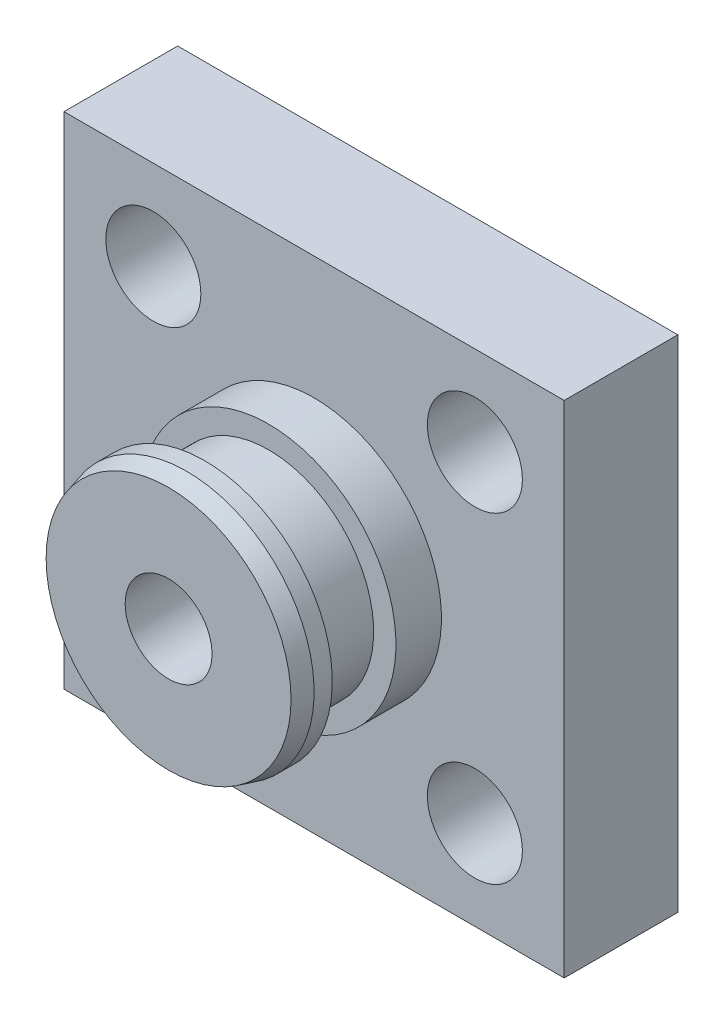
ISO-10303-21;
HEADER;
FILE_DESCRIPTION(('STEP AP214'),'2;1');
FILE_NAME('part.step','',(''),(''),'','','');
FILE_SCHEMA(('AUTOMOTIVE_DESIGN { 1 0 10303 214 1 1 1 1 }'));
ENDSEC;
DATA;
#1=APPLICATION_CONTEXT('core data for automotive mechanical design processes');
#2=APPLICATION_PROTOCOL_DEFINITION('international standard','automotive_design',2000,#1);
#3=PRODUCT_CONTEXT('',#1,'mechanical');
#4=PRODUCT('Part','Part','',(#3));
#5=PRODUCT_RELATED_PRODUCT_CATEGORY('part','',(#4));
#6=PRODUCT_DEFINITION_FORMATION('','',#4);
#7=PRODUCT_DEFINITION_CONTEXT('part definition',#1,'design');
#8=PRODUCT_DEFINITION('design','',#6,#7);
#9=PRODUCT_DEFINITION_SHAPE('','',#8);
#10=(LENGTH_UNIT() NAMED_UNIT(*) SI_UNIT(.MILLI.,.METRE.));
#11=(NAMED_UNIT(*) PLANE_ANGLE_UNIT() SI_UNIT($,.RADIAN.));
#12=(NAMED_UNIT(*) SI_UNIT($,.STERADIAN.) SOLID_ANGLE_UNIT());
#13=UNCERTAINTY_MEASURE_WITH_UNIT(LENGTH_MEASURE(1.E-05),#10,'distance_accuracy_value','');
#14=(GEOMETRIC_REPRESENTATION_CONTEXT(3) GLOBAL_UNCERTAINTY_ASSIGNED_CONTEXT((#13)) GLOBAL_UNIT_ASSIGNED_CONTEXT((#10,
#11,#12)) REPRESENTATION_CONTEXT('',''));
#15=CARTESIAN_POINT('',(0.,0.,0.));
#16=DIRECTION('',(0.,0.,1.));
#17=DIRECTION('',(1.,0.,0.));
#18=AXIS2_PLACEMENT_3D('',#15,#16,#17);
#19=CARTESIAN_POINT('',(0.,0.,50.7999999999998));
#20=DIRECTION('',(0.,0.,-0.999999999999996));
#21=DIRECTION('',(-0.999999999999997,0.,0.));
#22=AXIS2_PLACEMENT_3D('',#19,#20,#21);
#23=CYLINDRICAL_SURFACE('',#22,2.4257);
#24=CARTESIAN_POINT('',(0.,0.,14.478));
#25=DIRECTION('',(0.,0.,0.999999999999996));
#26=DIRECTION('',(0.999999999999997,0.,0.));
#27=AXIS2_PLACEMENT_3D('',#24,#25,#26);
#28=CIRCLE('',#27,2.4257);
#29=CARTESIAN_POINT('',(-2.42569999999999,0.,14.478));
#30=VERTEX_POINT('',#29);
#31=EDGE_CURVE('E112',#30,#30,#28,.T.);
#32=CARTESIAN_POINT('',(0.,0.,5.08));
#33=DIRECTION('',(0.,0.,-0.999999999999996));
#34=DIRECTION('',(-0.999999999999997,0.,0.));
#35=AXIS2_PLACEMENT_3D('',#32,#33,#34);
#36=CIRCLE('',#35,2.4257);
#37=CARTESIAN_POINT('',(-2.42569999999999,0.,5.08));
#38=VERTEX_POINT('',#37);
#39=EDGE_CURVE('E34',#38,#38,#36,.F.);
#40=CARTESIAN_POINT('',(-2.42569999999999,0.,14.478));
#41=CARTESIAN_POINT('',(-2.42569999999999,0.,14.3801041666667));
#42=CARTESIAN_POINT('',(-2.42569999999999,0.,14.2822083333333));
#43=CARTESIAN_POINT('',(-2.42569999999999,0.,14.0864166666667));
#44=CARTESIAN_POINT('',(-2.42569999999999,0.,13.9885208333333));
#45=CARTESIAN_POINT('',(-2.42569999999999,0.,13.7927291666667));
#46=CARTESIAN_POINT('',(-2.42569999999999,0.,13.6948333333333));
#47=CARTESIAN_POINT('',(-2.42569999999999,0.,13.4990416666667));
#48=CARTESIAN_POINT('',(-2.42569999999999,0.,13.4011458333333));
#49=CARTESIAN_POINT('',(-2.42569999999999,0.,13.2053541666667));
#50=CARTESIAN_POINT('',(-2.42569999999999,0.,13.1074583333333));
#51=CARTESIAN_POINT('',(-2.42569999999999,0.,12.9116666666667));
#52=CARTESIAN_POINT('',(-2.42569999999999,0.,12.8137708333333));
#53=CARTESIAN_POINT('',(-2.42569999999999,0.,12.6179791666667));
#54=CARTESIAN_POINT('',(-2.42569999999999,0.,12.5200833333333));
#55=CARTESIAN_POINT('',(-2.42569999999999,0.,12.3242916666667));
#56=CARTESIAN_POINT('',(-2.42569999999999,0.,12.2263958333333));
#57=CARTESIAN_POINT('',(-2.42569999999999,0.,12.0306041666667));
#58=CARTESIAN_POINT('',(-2.42569999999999,0.,11.9327083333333));
#59=CARTESIAN_POINT('',(-2.42569999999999,0.,11.7369166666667));
#60=CARTESIAN_POINT('',(-2.42569999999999,0.,11.6390208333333));
#61=CARTESIAN_POINT('',(-2.42569999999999,0.,11.4432291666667));
#62=CARTESIAN_POINT('',(-2.42569999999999,0.,11.3453333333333));
#63=CARTESIAN_POINT('',(-2.42569999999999,0.,11.1495416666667));
#64=CARTESIAN_POINT('',(-2.42569999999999,0.,11.0516458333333));
#65=CARTESIAN_POINT('',(-2.42569999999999,0.,10.8558541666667));
#66=CARTESIAN_POINT('',(-2.42569999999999,0.,10.7579583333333));
#67=CARTESIAN_POINT('',(-2.42569999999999,0.,10.5621666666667));
#68=CARTESIAN_POINT('',(-2.42569999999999,0.,10.4642708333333));
#69=CARTESIAN_POINT('',(-2.42569999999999,0.,10.2684791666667));
#70=CARTESIAN_POINT('',(-2.42569999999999,0.,10.1705833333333));
#71=CARTESIAN_POINT('',(-2.42569999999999,0.,9.97479166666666));
#72=CARTESIAN_POINT('',(-2.42569999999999,0.,9.87689583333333));
#73=CARTESIAN_POINT('',(-2.42569999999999,0.,9.68110416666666));
#74=CARTESIAN_POINT('',(-2.42569999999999,0.,9.58320833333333));
#75=CARTESIAN_POINT('',(-2.42569999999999,0.,9.38741666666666));
#76=CARTESIAN_POINT('',(-2.42569999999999,0.,9.28952083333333));
#77=CARTESIAN_POINT('',(-2.42569999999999,0.,9.09372916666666));
#78=CARTESIAN_POINT('',(-2.42569999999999,0.,8.99583333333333));
#79=CARTESIAN_POINT('',(-2.42569999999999,0.,8.80004166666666));
#80=CARTESIAN_POINT('',(-2.42569999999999,0.,8.70214583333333));
#81=CARTESIAN_POINT('',(-2.42569999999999,0.,8.50635416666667));
#82=CARTESIAN_POINT('',(-2.42569999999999,0.,8.40845833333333));
#83=CARTESIAN_POINT('',(-2.42569999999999,0.,8.21266666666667));
#84=CARTESIAN_POINT('',(-2.42569999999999,0.,8.11477083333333));
#85=CARTESIAN_POINT('',(-2.42569999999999,0.,7.91897916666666));
#86=CARTESIAN_POINT('',(-2.42569999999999,0.,7.82108333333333));
#87=CARTESIAN_POINT('',(-2.42569999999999,0.,7.62529166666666));
#88=CARTESIAN_POINT('',(-2.42569999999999,0.,7.52739583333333));
#89=CARTESIAN_POINT('',(-2.42569999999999,0.,7.33160416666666));
#90=CARTESIAN_POINT('',(-2.42569999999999,0.,7.23370833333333));
#91=CARTESIAN_POINT('',(-2.42569999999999,0.,7.03791666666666));
#92=CARTESIAN_POINT('',(-2.42569999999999,0.,6.94002083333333));
#93=CARTESIAN_POINT('',(-2.42569999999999,0.,6.74422916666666));
#94=CARTESIAN_POINT('',(-2.42569999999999,0.,6.64633333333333));
#95=CARTESIAN_POINT('',(-2.42569999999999,0.,6.45054166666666));
#96=CARTESIAN_POINT('',(-2.42569999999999,0.,6.35264583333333));
#97=CARTESIAN_POINT('',(-2.42569999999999,0.,6.15685416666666));
#98=CARTESIAN_POINT('',(-2.42569999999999,0.,6.05895833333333));
#99=CARTESIAN_POINT('',(-2.42569999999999,0.,5.86316666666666));
#100=CARTESIAN_POINT('',(-2.42569999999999,0.,5.76527083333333));
#101=CARTESIAN_POINT('',(-2.42569999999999,0.,5.56947916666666));
#102=CARTESIAN_POINT('',(-2.42569999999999,0.,5.47158333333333));
#103=CARTESIAN_POINT('',(-2.42569999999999,0.,5.27579166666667));
#104=CARTESIAN_POINT('',(-2.42569999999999,0.,5.17789583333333));
#105=CARTESIAN_POINT('',(-2.42569999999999,0.,5.08));
#106=B_SPLINE_CURVE_WITH_KNOTS('',3,(#40,#41,#42,#43,#44,#45,#46,#47,#48,#49,#50,#51,#52,#53,
#54,#55,#56,#57,#58,#59,#60,#61,#62,#63,#64,#65,#66,#67,#68,#69,#70,#71,#72,#73,#74,#75,#76,#77,
#78,#79,#80,#81,#82,#83,#84,#85,#86,#87,#88,#89,#90,#91,#92,#93,#94,#95,#96,#97,#98,#99,#100,
#101,#102,#103,#104,#105),.UNSPECIFIED.,.F.,.F.,(4,2,2,2,2,2,2,2,2,2,2,2,2,2,2,2,2,2,2,2,2,2,2,
2,2,2,2,2,2,2,2,2,4),(0.,0.293687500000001,0.587375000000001,0.881062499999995,1.17475,
1.4684375,1.762125,2.0558125,2.34949999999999,2.6431875,2.936875,3.2305625,3.52425,3.8179375,
4.11162499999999,4.40531249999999,4.69899999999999,4.9926875,5.286375,5.5800625,
5.87374999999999,6.16743749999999,6.46112499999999,6.7548125,7.0485,7.34218749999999,
7.63587499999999,7.92956249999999,8.22324999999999,8.5169375,8.810625,9.10431249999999,
9.39799999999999),.UNSPECIFIED.);
#107=EDGE_CURVE('BSEAM30',#30,#38,#106,.T.);
#108=ORIENTED_EDGE('',*,*,#31,.T.);
#109=ORIENTED_EDGE('',*,*,#39,.F.);
#110=ORIENTED_EDGE('',*,*,#107,.T.);
#111=ORIENTED_EDGE('',*,*,#107,.F.);
#112=EDGE_LOOP('',(#108,#110,#109,#111));
#113=FACE_BOUND('',#112,.T.);
#114=ADVANCED_FACE('F30',(#113),#23,.F.);
#115=CARTESIAN_POINT('',(0.,0.,8.88999999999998));
#116=DIRECTION('',(0.,0.,0.999999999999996));
#117=DIRECTION('',(0.999999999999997,0.,0.));
#118=AXIS2_PLACEMENT_3D('',#115,#116,#117);
#119=PLANE('',#118);
#120=CARTESIAN_POINT('',(0.,0.,8.88999999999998));
#121=DIRECTION('',(0.,0.,0.999999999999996));
#122=DIRECTION('',(0.999999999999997,0.,0.));
#123=AXIS2_PLACEMENT_3D('',#120,#121,#122);
#124=CIRCLE('',#123,7.112);
#125=CARTESIAN_POINT('',(-7.11199999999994,0.,8.88999999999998));
#126=VERTEX_POINT('',#125);
#127=EDGE_CURVE('E104',#126,#126,#124,.T.);
#128=ORIENTED_EDGE('',*,*,#127,.T.);
#129=EDGE_LOOP('',(#128));
#130=FACE_BOUND('',#129,.T.);
#131=CARTESIAN_POINT('',(0.,0.,8.88999999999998));
#132=DIRECTION('',(0.,0.,0.999999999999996));
#133=DIRECTION('',(0.999999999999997,0.,0.));
#134=AXIS2_PLACEMENT_3D('',#131,#132,#133);
#135=CIRCLE('',#134,5.8674);
#136=CARTESIAN_POINT('',(-5.86739999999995,0.,8.88999999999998));
#137=VERTEX_POINT('',#136);
#138=EDGE_CURVE('E155',#137,#137,#135,.T.);
#139=ORIENTED_EDGE('',*,*,#138,.F.);
#140=EDGE_LOOP('',(#139));
#141=FACE_BOUND('',#140,.T.);
#142=ADVANCED_FACE('F170',(#130,#141),#119,.T.);
#143=CARTESIAN_POINT('',(13.97,-13.97,6.34999999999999));
#144=DIRECTION('',(0.,0.,0.999999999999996));
#145=DIRECTION('',(0.999999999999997,0.,0.));
#146=AXIS2_PLACEMENT_3D('',#143,#144,#145);
#147=PLANE('',#146);
#148=CARTESIAN_POINT('',(-8.98025612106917,8.98025612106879,6.34999999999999));
#149=DIRECTION('',(0.,0.,0.999999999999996));
#150=DIRECTION('',(0.999999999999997,0.,0.));
#151=AXIS2_PLACEMENT_3D('',#148,#149,#150);
#152=CIRCLE('',#151,2.6543);
#153=CARTESIAN_POINT('',(-6.32595612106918,8.98025612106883,6.34999999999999));
#154=VERTEX_POINT('',#153);
#155=EDGE_CURVE('E114',#154,#154,#152,.T.);
#156=ORIENTED_EDGE('',*,*,#155,.F.);
#157=EDGE_LOOP('',(#156));
#158=FACE_BOUND('',#157,.T.);
#159=CARTESIAN_POINT('',(-8.98025612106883,-8.98025612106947,6.34999999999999));
#160=DIRECTION('',(0.,0.,0.999999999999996));
#161=DIRECTION('',(0.999999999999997,0.,0.));
#162=AXIS2_PLACEMENT_3D('',#159,#160,#161);
#163=CIRCLE('',#162,2.6543);
#164=CARTESIAN_POINT('',(-6.32595612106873,-8.98025612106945,6.34999999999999));
#165=VERTEX_POINT('',#164);
#166=EDGE_CURVE('E133',#165,#165,#163,.T.);
#167=ORIENTED_EDGE('',*,*,#166,.F.);
#168=EDGE_LOOP('',(#167));
#169=FACE_BOUND('',#168,.T.);
#170=CARTESIAN_POINT('',(8.98025612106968,-8.98025612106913,6.34999999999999));
#171=DIRECTION('',(0.,0.,0.999999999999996));
#172=DIRECTION('',(0.999999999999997,0.,0.));
#173=AXIS2_PLACEMENT_3D('',#170,#171,#172);
#174=CIRCLE('',#173,2.6543);
#175=CARTESIAN_POINT('',(11.6345561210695,-8.98025612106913,6.34999999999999));
#176=VERTEX_POINT('',#175);
#177=EDGE_CURVE('E138',#176,#176,#174,.T.);
#178=ORIENTED_EDGE('',*,*,#177,.F.);
#179=EDGE_LOOP('',(#178));
#180=FACE_BOUND('',#179,.T.);
#181=CARTESIAN_POINT('',(8.98025612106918,8.98025612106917,6.34999999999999));
#182=DIRECTION('',(0.,0.,0.999999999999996));
#183=DIRECTION('',(0.999999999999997,0.,0.));
#184=AXIS2_PLACEMENT_3D('',#181,#182,#183);
#185=CIRCLE('',#184,2.6543);
#186=CARTESIAN_POINT('',(11.6345561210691,8.98025612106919,6.34999999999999));
#187=VERTEX_POINT('',#186);
#188=EDGE_CURVE('E144',#187,#187,#185,.T.);
#189=ORIENTED_EDGE('',*,*,#188,.F.);
#190=EDGE_LOOP('',(#189));
#191=FACE_BOUND('',#190,.T.);
#192=DIRECTION('',(0.,0.999999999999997,0.));
#193=VECTOR('',#192,1.);
#194=CARTESIAN_POINT('',(13.97,13.9699999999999,6.34999999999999));
#195=LINE('',#194,#193);
#196=CARTESIAN_POINT('',(13.97,-13.97,6.34999999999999));
#197=VERTEX_POINT('',#196);
#198=CARTESIAN_POINT('',(13.97,13.9699999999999,6.34999999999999));
#199=VERTEX_POINT('',#198);
#200=EDGE_CURVE('E86',#197,#199,#195,.T.);
#201=ORIENTED_EDGE('',*,*,#200,.T.);
#202=DIRECTION('',(-0.999999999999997,0.,0.));
#203=VECTOR('',#202,1.);
#204=CARTESIAN_POINT('',(-13.97,13.9699999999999,6.34999999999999));
#205=LINE('',#204,#203);
#206=CARTESIAN_POINT('',(-13.97,13.9699999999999,6.34999999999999));
#207=VERTEX_POINT('',#206);
#208=EDGE_CURVE('E80',#199,#207,#205,.T.);
#209=ORIENTED_EDGE('',*,*,#208,.T.);
#210=DIRECTION('',(0.,-0.999999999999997,0.));
#211=VECTOR('',#210,1.);
#212=CARTESIAN_POINT('',(-13.97,13.9699999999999,6.34999999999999));
#213=LINE('',#212,#211);
#214=CARTESIAN_POINT('',(-13.97,-13.97,6.34999999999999));
#215=VERTEX_POINT('',#214);
#216=EDGE_CURVE('E84',#207,#215,#213,.T.);
#217=ORIENTED_EDGE('',*,*,#216,.T.);
#218=DIRECTION('',(0.999999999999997,0.,0.));
#219=VECTOR('',#218,1.);
#220=CARTESIAN_POINT('',(-13.97,-13.97,6.34999999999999));
#221=LINE('',#220,#219);
#222=EDGE_CURVE('E49',#215,#197,#221,.T.);
#223=ORIENTED_EDGE('',*,*,#222,.T.);
#224=EDGE_LOOP('',(#201,#209,#217,#223));
#225=FACE_BOUND('',#224,.T.);
#226=CARTESIAN_POINT('',(0.,0.,6.34999999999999));
#227=DIRECTION('',(0.,0.,0.999999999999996));
#228=DIRECTION('',(0.999999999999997,0.,0.));
#229=AXIS2_PLACEMENT_3D('',#226,#227,#228);
#230=CIRCLE('',#229,7.112);
#231=CARTESIAN_POINT('',(-7.11199999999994,0.,6.34999999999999));
#232=VERTEX_POINT('',#231);
#233=EDGE_CURVE('E159',#232,#232,#230,.T.);
#234=ORIENTED_EDGE('',*,*,#233,.F.);
#235=EDGE_LOOP('',(#234));
#236=FACE_BOUND('',#235,.T.);
#237=ADVANCED_FACE('F81',(#158,#169,#180,#191,#225,#236),#147,.T.);
#238=CARTESIAN_POINT('',(13.97,13.9699999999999,6.34999999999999));
#239=DIRECTION('',(-0.999999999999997,0.,0.));
#240=DIRECTION('',(0.,0.,0.999999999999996));
#241=AXIS2_PLACEMENT_3D('',#238,#239,#240);
#242=PLANE('',#241);
#243=DIRECTION('',(0.,0.999999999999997,0.));
#244=VECTOR('',#243,1.);
#245=CARTESIAN_POINT('',(13.97,13.97,0.));
#246=LINE('',#245,#244);
#247=CARTESIAN_POINT('',(13.97,-13.97,0.));
#248=VERTEX_POINT('',#247);
#249=CARTESIAN_POINT('',(13.97,13.97,0.));
#250=VERTEX_POINT('',#249);
#251=EDGE_CURVE('E101',#248,#250,#246,.T.);
#252=ORIENTED_EDGE('',*,*,#251,.T.);
#253=DIRECTION('',(0.,0.,-0.999999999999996));
#254=VECTOR('',#253,1.);
#255=CARTESIAN_POINT('',(13.97,13.9699999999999,6.34999999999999));
#256=LINE('',#255,#254);
#257=EDGE_CURVE('E92',#199,#250,#256,.T.);
#258=ORIENTED_EDGE('',*,*,#257,.F.);
#259=ORIENTED_EDGE('',*,*,#200,.F.);
#260=DIRECTION('',(0.,0.,-0.999999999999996));
#261=VECTOR('',#260,1.);
#262=CARTESIAN_POINT('',(13.97,-13.97,6.34999999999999));
#263=LINE('',#262,#261);
#264=EDGE_CURVE('E97',#197,#248,#263,.T.);
#265=ORIENTED_EDGE('',*,*,#264,.T.);
#266=EDGE_LOOP('',(#252,#258,#259,#265));
#267=FACE_BOUND('',#266,.T.);
#268=ADVANCED_FACE('F169',(#267),#242,.F.);
#269=CARTESIAN_POINT('',(-13.97,13.9699999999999,6.34999999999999));
#270=DIRECTION('',(0.,-0.999999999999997,0.));
#271=DIRECTION('',(0.,0.,-0.999999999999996));
#272=AXIS2_PLACEMENT_3D('',#269,#270,#271);
#273=PLANE('',#272);
#274=DIRECTION('',(-0.999999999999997,0.,0.));
#275=VECTOR('',#274,1.);
#276=CARTESIAN_POINT('',(-13.97,13.97,0.));
#277=LINE('',#276,#275);
#278=CARTESIAN_POINT('',(-13.97,13.97,0.));
#279=VERTEX_POINT('',#278);
#280=EDGE_CURVE('E91',#250,#279,#277,.T.);
#281=ORIENTED_EDGE('',*,*,#280,.T.);
#282=DIRECTION('',(0.,0.,-0.999999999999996));
#283=VECTOR('',#282,1.);
#284=CARTESIAN_POINT('',(-13.97,13.9699999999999,6.34999999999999));
#285=LINE('',#284,#283);
#286=EDGE_CURVE('E89',#207,#279,#285,.T.);
#287=ORIENTED_EDGE('',*,*,#286,.F.);
#288=ORIENTED_EDGE('',*,*,#208,.F.);
#289=ORIENTED_EDGE('',*,*,#257,.T.);
#290=EDGE_LOOP('',(#281,#287,#288,#289));
#291=FACE_BOUND('',#290,.T.);
#292=ADVANCED_FACE('F90',(#291),#273,.F.);
#293=CARTESIAN_POINT('',(-13.97,13.9699999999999,6.34999999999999));
#294=DIRECTION('',(0.999999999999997,0.,0.));
#295=DIRECTION('',(0.,0.,-0.999999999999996));
#296=AXIS2_PLACEMENT_3D('',#293,#294,#295);
#297=PLANE('',#296);
#298=DIRECTION('',(0.,-0.999999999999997,0.));
#299=VECTOR('',#298,1.);
#300=CARTESIAN_POINT('',(-13.97,13.97,0.));
#301=LINE('',#300,#299);
#302=CARTESIAN_POINT('',(-13.97,-13.97,0.));
#303=VERTEX_POINT('',#302);
#304=EDGE_CURVE('E66',#279,#303,#301,.T.);
#305=ORIENTED_EDGE('',*,*,#304,.T.);
#306=DIRECTION('',(0.,0.,-0.999999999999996));
#307=VECTOR('',#306,1.);
#308=CARTESIAN_POINT('',(-13.97,-13.97,6.34999999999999));
#309=LINE('',#308,#307);
#310=EDGE_CURVE('E93',#215,#303,#309,.T.);
#311=ORIENTED_EDGE('',*,*,#310,.F.);
#312=ORIENTED_EDGE('',*,*,#216,.F.);
#313=ORIENTED_EDGE('',*,*,#286,.T.);
#314=EDGE_LOOP('',(#305,#311,#312,#313));
#315=FACE_BOUND('',#314,.T.);
#316=ADVANCED_FACE('F95',(#315),#297,.F.);
#317=CARTESIAN_POINT('',(-13.97,-13.97,6.34999999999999));
#318=DIRECTION('',(0.,0.999999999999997,0.));
#319=DIRECTION('',(0.,0.,0.999999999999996));
#320=AXIS2_PLACEMENT_3D('',#317,#318,#319);
#321=PLANE('',#320);
#322=DIRECTION('',(0.999999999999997,0.,0.));
#323=VECTOR('',#322,1.);
#324=CARTESIAN_POINT('',(-13.97,-13.97,0.));
#325=LINE('',#324,#323);
#326=EDGE_CURVE('E72',#303,#248,#325,.T.);
#327=ORIENTED_EDGE('',*,*,#326,.T.);
#328=ORIENTED_EDGE('',*,*,#264,.F.);
#329=ORIENTED_EDGE('',*,*,#222,.F.);
#330=ORIENTED_EDGE('',*,*,#310,.T.);
#331=EDGE_LOOP('',(#327,#328,#329,#330));
#332=FACE_BOUND('',#331,.T.);
#333=ADVANCED_FACE('F230',(#332),#321,.F.);
#334=CARTESIAN_POINT('',(13.97,-13.97,0.));
#335=DIRECTION('',(0.,0.,0.999999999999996));
#336=DIRECTION('',(0.999999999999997,0.,0.));
#337=AXIS2_PLACEMENT_3D('',#334,#335,#336);
#338=PLANE('',#337);
#339=CARTESIAN_POINT('',(0.,0.,0.));
#340=DIRECTION('',(0.,0.,-0.999999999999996));
#341=DIRECTION('',(-0.999999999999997,0.,0.));
#342=AXIS2_PLACEMENT_3D('',#339,#340,#341);
#343=CIRCLE('',#342,3.2004);
#344=CARTESIAN_POINT('',(-3.20039999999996,0.,0.));
#345=VERTEX_POINT('',#344);
#346=EDGE_CURVE('E125',#345,#345,#343,.T.);
#347=ORIENTED_EDGE('',*,*,#346,.F.);
#348=EDGE_LOOP('',(#347));
#349=FACE_BOUND('',#348,.T.);
#350=CARTESIAN_POINT('',(-8.98025612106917,8.98025612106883,0.));
#351=DIRECTION('',(0.,0.,0.999999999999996));
#352=DIRECTION('',(0.999999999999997,0.,0.));
#353=AXIS2_PLACEMENT_3D('',#350,#351,#352);
#354=CIRCLE('',#353,2.6543);
#355=CARTESIAN_POINT('',(-6.32595612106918,8.98025612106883,0.));
#356=VERTEX_POINT('',#355);
#357=EDGE_CURVE('E118',#356,#356,#354,.T.);
#358=ORIENTED_EDGE('',*,*,#357,.T.);
#359=EDGE_LOOP('',(#358));
#360=FACE_BOUND('',#359,.T.);
#361=CARTESIAN_POINT('',(-8.98025612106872,-8.98025612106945,0.));
#362=DIRECTION('',(0.,0.,0.999999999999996));
#363=DIRECTION('',(0.999999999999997,0.,0.));
#364=AXIS2_PLACEMENT_3D('',#361,#362,#363);
#365=CIRCLE('',#364,2.6543);
#366=CARTESIAN_POINT('',(-6.32595612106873,-8.98025612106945,0.));
#367=VERTEX_POINT('',#366);
#368=EDGE_CURVE('E135',#367,#367,#365,.T.);
#369=ORIENTED_EDGE('',*,*,#368,.T.);
#370=EDGE_LOOP('',(#369));
#371=FACE_BOUND('',#370,.T.);
#372=CARTESIAN_POINT('',(8.98025612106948,-8.98025612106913,0.));
#373=DIRECTION('',(0.,0.,0.999999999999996));
#374=DIRECTION('',(0.999999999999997,0.,0.));
#375=AXIS2_PLACEMENT_3D('',#372,#373,#374);
#376=CIRCLE('',#375,2.6543);
#377=CARTESIAN_POINT('',(11.6345561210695,-8.98025612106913,0.));
#378=VERTEX_POINT('',#377);
#379=EDGE_CURVE('E141',#378,#378,#376,.T.);
#380=ORIENTED_EDGE('',*,*,#379,.T.);
#381=EDGE_LOOP('',(#380));
#382=FACE_BOUND('',#381,.T.);
#383=CARTESIAN_POINT('',(8.98025612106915,8.98025612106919,0.));
#384=DIRECTION('',(0.,0.,0.999999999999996));
#385=DIRECTION('',(0.999999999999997,0.,0.));
#386=AXIS2_PLACEMENT_3D('',#383,#384,#385);
#387=CIRCLE('',#386,2.6543);
#388=CARTESIAN_POINT('',(11.6345561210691,8.98025612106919,0.));
#389=VERTEX_POINT('',#388);
#390=EDGE_CURVE('E147',#389,#389,#387,.T.);
#391=ORIENTED_EDGE('',*,*,#390,.T.);
#392=EDGE_LOOP('',(#391));
#393=FACE_BOUND('',#392,.T.);
#394=ORIENTED_EDGE('',*,*,#251,.F.);
#395=ORIENTED_EDGE('',*,*,#326,.F.);
#396=ORIENTED_EDGE('',*,*,#304,.F.);
#397=ORIENTED_EDGE('',*,*,#280,.F.);
#398=EDGE_LOOP('',(#394,#395,#396,#397));
#399=FACE_BOUND('',#398,.T.);
#400=ADVANCED_FACE('F225',(#349,#360,#371,#382,#393,#399),#338,.F.);
#401=CARTESIAN_POINT('',(0.,0.,8.88999999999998));
#402=DIRECTION('',(0.,0.,-0.999999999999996));
#403=DIRECTION('',(-0.999999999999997,0.,0.));
#404=AXIS2_PLACEMENT_3D('',#401,#402,#403);
#405=CYLINDRICAL_SURFACE('',#404,7.112);
#406=CARTESIAN_POINT('',(-7.11199999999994,0.,8.88999999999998));
#407=CARTESIAN_POINT('',(-7.11199999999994,0.,8.86354166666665));
#408=CARTESIAN_POINT('',(-7.11199999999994,0.,8.83708333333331));
#409=CARTESIAN_POINT('',(-7.11199999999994,0.,8.78416666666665));
#410=CARTESIAN_POINT('',(-7.11199999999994,0.,8.75770833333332));
#411=CARTESIAN_POINT('',(-7.11199999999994,0.,8.70479166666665));
#412=CARTESIAN_POINT('',(-7.11199999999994,0.,8.67833333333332));
#413=CARTESIAN_POINT('',(-7.11199999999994,0.,8.62541666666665));
#414=CARTESIAN_POINT('',(-7.11199999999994,0.,8.59895833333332));
#415=CARTESIAN_POINT('',(-7.11199999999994,0.,8.54604166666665));
#416=CARTESIAN_POINT('',(-7.11199999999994,0.,8.51958333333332));
#417=CARTESIAN_POINT('',(-7.11199999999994,0.,8.46666666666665));
#418=CARTESIAN_POINT('',(-7.11199999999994,0.,8.44020833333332));
#419=CARTESIAN_POINT('',(-7.11199999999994,0.,8.38729166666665));
#420=CARTESIAN_POINT('',(-7.11199999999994,0.,8.36083333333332));
#421=CARTESIAN_POINT('',(-7.11199999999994,0.,8.30791666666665));
#422=CARTESIAN_POINT('',(-7.11199999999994,0.,8.28145833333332));
#423=CARTESIAN_POINT('',(-7.11199999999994,0.,8.22854166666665));
#424=CARTESIAN_POINT('',(-7.11199999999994,0.,8.20208333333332));
#425=CARTESIAN_POINT('',(-7.11199999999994,0.,8.14916666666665));
#426=CARTESIAN_POINT('',(-7.11199999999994,0.,8.12270833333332));
#427=CARTESIAN_POINT('',(-7.11199999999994,0.,8.06979166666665));
#428=CARTESIAN_POINT('',(-7.11199999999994,0.,8.04333333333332));
#429=CARTESIAN_POINT('',(-7.11199999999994,0.,7.99041666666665));
#430=CARTESIAN_POINT('',(-7.11199999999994,0.,7.96395833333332));
#431=CARTESIAN_POINT('',(-7.11199999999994,0.,7.91104166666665));
#432=CARTESIAN_POINT('',(-7.11199999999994,0.,7.88458333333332));
#433=CARTESIAN_POINT('',(-7.11199999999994,0.,7.83166666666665));
#434=CARTESIAN_POINT('',(-7.11199999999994,0.,7.80520833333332));
#435=CARTESIAN_POINT('',(-7.11199999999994,0.,7.75229166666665));
#436=CARTESIAN_POINT('',(-7.11199999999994,0.,7.72583333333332));
#437=CARTESIAN_POINT('',(-7.11199999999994,0.,7.67291666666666));
#438=CARTESIAN_POINT('',(-7.11199999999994,0.,7.64645833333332));
#439=CARTESIAN_POINT('',(-7.11199999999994,0.,7.59354166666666));
#440=CARTESIAN_POINT('',(-7.11199999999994,0.,7.56708333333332));
#441=CARTESIAN_POINT('',(-7.11199999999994,0.,7.51416666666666));
#442=CARTESIAN_POINT('',(-7.11199999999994,0.,7.48770833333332));
#443=CARTESIAN_POINT('',(-7.11199999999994,0.,7.43479166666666));
#444=CARTESIAN_POINT('',(-7.11199999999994,0.,7.40833333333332));
#445=CARTESIAN_POINT('',(-7.11199999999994,0.,7.35541666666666));
#446=CARTESIAN_POINT('',(-7.11199999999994,0.,7.32895833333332));
#447=CARTESIAN_POINT('',(-7.11199999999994,0.,7.27604166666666));
#448=CARTESIAN_POINT('',(-7.11199999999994,0.,7.24958333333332));
#449=CARTESIAN_POINT('',(-7.11199999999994,0.,7.19666666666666));
#450=CARTESIAN_POINT('',(-7.11199999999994,0.,7.17020833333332));
#451=CARTESIAN_POINT('',(-7.11199999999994,0.,7.11729166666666));
#452=CARTESIAN_POINT('',(-7.11199999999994,0.,7.09083333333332));
#453=CARTESIAN_POINT('',(-7.11199999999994,0.,7.03791666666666));
#454=CARTESIAN_POINT('',(-7.11199999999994,0.,7.01145833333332));
#455=CARTESIAN_POINT('',(-7.11199999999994,0.,6.95854166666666));
#456=CARTESIAN_POINT('',(-7.11199999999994,0.,6.93208333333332));
#457=CARTESIAN_POINT('',(-7.11199999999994,0.,6.87916666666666));
#458=CARTESIAN_POINT('',(-7.11199999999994,0.,6.85270833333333));
#459=CARTESIAN_POINT('',(-7.11199999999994,0.,6.79979166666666));
#460=CARTESIAN_POINT('',(-7.11199999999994,0.,6.77333333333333));
#461=CARTESIAN_POINT('',(-7.11199999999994,0.,6.72041666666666));
#462=CARTESIAN_POINT('',(-7.11199999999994,0.,6.69395833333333));
#463=CARTESIAN_POINT('',(-7.11199999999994,0.,6.64104166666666));
#464=CARTESIAN_POINT('',(-7.11199999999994,0.,6.61458333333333));
#465=CARTESIAN_POINT('',(-7.11199999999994,0.,6.56166666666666));
#466=CARTESIAN_POINT('',(-7.11199999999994,0.,6.53520833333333));
#467=CARTESIAN_POINT('',(-7.11199999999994,0.,6.48229166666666));
#468=CARTESIAN_POINT('',(-7.11199999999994,0.,6.45583333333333));
#469=CARTESIAN_POINT('',(-7.11199999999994,0.,6.40291666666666));
#470=CARTESIAN_POINT('',(-7.11199999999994,0.,6.37645833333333));
#471=CARTESIAN_POINT('',(-7.11199999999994,0.,6.34999999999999));
#472=B_SPLINE_CURVE_WITH_KNOTS('',3,(#406,#407,#408,#409,#410,#411,#412,#413,#414,#415,#416,
#417,#418,#419,#420,#421,#422,#423,#424,#425,#426,#427,#428,#429,#430,#431,#432,#433,#434,#435,
#436,#437,#438,#439,#440,#441,#442,#443,#444,#445,#446,#447,#448,#449,#450,#451,#452,#453,#454,
#455,#456,#457,#458,#459,#460,#461,#462,#463,#464,#465,#466,#467,#468,#469,#470,#471),
.UNSPECIFIED.,.F.,.F.,(4,2,2,2,2,2,2,2,2,2,2,2,2,2,2,2,2,2,2,2,2,2,2,2,2,2,2,2,2,2,2,2,4),(0.,
0.0793749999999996,0.158749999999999,0.238124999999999,0.317499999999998,0.396874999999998,
0.476249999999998,0.555624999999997,0.634999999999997,0.714374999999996,0.793749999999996,
0.873124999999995,0.952499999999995,1.03187499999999,1.11124999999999,1.19062499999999,
1.26999999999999,1.34937499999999,1.42874999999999,1.50812499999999,1.58749999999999,
1.66687499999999,1.74624999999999,1.82562499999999,1.90499999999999,1.98437499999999,
2.06374999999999,2.14312499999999,2.22249999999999,2.30187499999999,2.38124999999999,
2.46062499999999,2.53999999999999),.UNSPECIFIED.);
#473=EDGE_CURVE('BSEAM167',#126,#232,#472,.T.);
#474=ORIENTED_EDGE('',*,*,#127,.F.);
#475=ORIENTED_EDGE('',*,*,#233,.T.);
#476=ORIENTED_EDGE('',*,*,#473,.T.);
#477=ORIENTED_EDGE('',*,*,#473,.F.);
#478=EDGE_LOOP('',(#474,#476,#475,#477));
#479=FACE_BOUND('',#478,.T.);
#480=ADVANCED_FACE('F167',(#479),#405,.T.);
#481=CARTESIAN_POINT('',(0.,0.,12.446));
#482=DIRECTION('',(0.,0.,-0.999999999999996));
#483=DIRECTION('',(-0.999999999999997,0.,0.));
#484=AXIS2_PLACEMENT_3D('',#481,#482,#483);
#485=CYLINDRICAL_SURFACE('',#484,5.8674);
#486=CARTESIAN_POINT('',(0.,0.,12.446));
#487=DIRECTION('',(0.,0.,0.999999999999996));
#488=DIRECTION('',(0.999999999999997,0.,0.));
#489=AXIS2_PLACEMENT_3D('',#486,#487,#488);
#490=CIRCLE('',#489,5.8674);
#491=CARTESIAN_POINT('',(-5.86739999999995,0.,12.446));
#492=VERTEX_POINT('',#491);
#493=EDGE_CURVE('E156',#492,#492,#490,.T.);
#494=CARTESIAN_POINT('',(-5.86739999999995,0.,12.446));
#495=CARTESIAN_POINT('',(-5.86739999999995,0.,12.4089583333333));
#496=CARTESIAN_POINT('',(-5.86739999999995,0.,12.3719166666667));
#497=CARTESIAN_POINT('',(-5.86739999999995,0.,12.2978333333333));
#498=CARTESIAN_POINT('',(-5.86739999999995,0.,12.2607916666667));
#499=CARTESIAN_POINT('',(-5.86739999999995,0.,12.1867083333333));
#500=CARTESIAN_POINT('',(-5.86739999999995,0.,12.1496666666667));
#501=CARTESIAN_POINT('',(-5.86739999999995,0.,12.0755833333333));
#502=CARTESIAN_POINT('',(-5.86739999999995,0.,12.0385416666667));
#503=CARTESIAN_POINT('',(-5.86739999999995,0.,11.9644583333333));
#504=CARTESIAN_POINT('',(-5.86739999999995,0.,11.9274166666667));
#505=CARTESIAN_POINT('',(-5.86739999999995,0.,11.8533333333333));
#506=CARTESIAN_POINT('',(-5.86739999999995,0.,11.8162916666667));
#507=CARTESIAN_POINT('',(-5.86739999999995,0.,11.7422083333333));
#508=CARTESIAN_POINT('',(-5.86739999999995,0.,11.7051666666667));
#509=CARTESIAN_POINT('',(-5.86739999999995,0.,11.6310833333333));
#510=CARTESIAN_POINT('',(-5.86739999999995,0.,11.5940416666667));
#511=CARTESIAN_POINT('',(-5.86739999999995,0.,11.5199583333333));
#512=CARTESIAN_POINT('',(-5.86739999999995,0.,11.4829166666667));
#513=CARTESIAN_POINT('',(-5.86739999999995,0.,11.4088333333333));
#514=CARTESIAN_POINT('',(-5.86739999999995,0.,11.3717916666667));
#515=CARTESIAN_POINT('',(-5.86739999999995,0.,11.2977083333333));
#516=CARTESIAN_POINT('',(-5.86739999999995,0.,11.2606666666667));
#517=CARTESIAN_POINT('',(-5.86739999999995,0.,11.1865833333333));
#518=CARTESIAN_POINT('',(-5.86739999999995,0.,11.1495416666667));
#519=CARTESIAN_POINT('',(-5.86739999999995,0.,11.0754583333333));
#520=CARTESIAN_POINT('',(-5.86739999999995,0.,11.0384166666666));
#521=CARTESIAN_POINT('',(-5.86739999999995,0.,10.9643333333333));
#522=CARTESIAN_POINT('',(-5.86739999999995,0.,10.9272916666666));
#523=CARTESIAN_POINT('',(-5.86739999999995,0.,10.8532083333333));
#524=CARTESIAN_POINT('',(-5.86739999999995,0.,10.8161666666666));
#525=CARTESIAN_POINT('',(-5.86739999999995,0.,10.7420833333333));
#526=CARTESIAN_POINT('',(-5.86739999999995,0.,10.7050416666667));
#527=CARTESIAN_POINT('',(-5.86739999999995,0.,10.6309583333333));
#528=CARTESIAN_POINT('',(-5.86739999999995,0.,10.5939166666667));
#529=CARTESIAN_POINT('',(-5.86739999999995,0.,10.5198333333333));
#530=CARTESIAN_POINT('',(-5.86739999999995,0.,10.4827916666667));
#531=CARTESIAN_POINT('',(-5.86739999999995,0.,10.4087083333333));
#532=CARTESIAN_POINT('',(-5.86739999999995,0.,10.3716666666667));
#533=CARTESIAN_POINT('',(-5.86739999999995,0.,10.2975833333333));
#534=CARTESIAN_POINT('',(-5.86739999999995,0.,10.2605416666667));
#535=CARTESIAN_POINT('',(-5.86739999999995,0.,10.1864583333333));
#536=CARTESIAN_POINT('',(-5.86739999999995,0.,10.1494166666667));
#537=CARTESIAN_POINT('',(-5.86739999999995,0.,10.0753333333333));
#538=CARTESIAN_POINT('',(-5.86739999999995,0.,10.0382916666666));
#539=CARTESIAN_POINT('',(-5.86739999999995,0.,9.96420833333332));
#540=CARTESIAN_POINT('',(-5.86739999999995,0.,9.92716666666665));
#541=CARTESIAN_POINT('',(-5.86739999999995,0.,9.85308333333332));
#542=CARTESIAN_POINT('',(-5.86739999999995,0.,9.81604166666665));
#543=CARTESIAN_POINT('',(-5.86739999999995,0.,9.74195833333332));
#544=CARTESIAN_POINT('',(-5.86739999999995,0.,9.70491666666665));
#545=CARTESIAN_POINT('',(-5.86739999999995,0.,9.63083333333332));
#546=CARTESIAN_POINT('',(-5.86739999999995,0.,9.59379166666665));
#547=CARTESIAN_POINT('',(-5.86739999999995,0.,9.51970833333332));
#548=CARTESIAN_POINT('',(-5.86739999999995,0.,9.48266666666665));
#549=CARTESIAN_POINT('',(-5.86739999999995,0.,9.40858333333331));
#550=CARTESIAN_POINT('',(-5.86739999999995,0.,9.37154166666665));
#551=CARTESIAN_POINT('',(-5.86739999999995,0.,9.29745833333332));
#552=CARTESIAN_POINT('',(-5.86739999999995,0.,9.26041666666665));
#553=CARTESIAN_POINT('',(-5.86739999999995,0.,9.18633333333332));
#554=CARTESIAN_POINT('',(-5.86739999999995,0.,9.14929166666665));
#555=CARTESIAN_POINT('',(-5.86739999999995,0.,9.07520833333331));
#556=CARTESIAN_POINT('',(-5.86739999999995,0.,9.03816666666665));
#557=CARTESIAN_POINT('',(-5.86739999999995,0.,8.96408333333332));
#558=CARTESIAN_POINT('',(-5.86739999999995,0.,8.92704166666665));
#559=CARTESIAN_POINT('',(-5.86739999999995,0.,8.88999999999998));
#560=B_SPLINE_CURVE_WITH_KNOTS('',3,(#494,#495,#496,#497,#498,#499,#500,#501,#502,#503,#504,
#505,#506,#507,#508,#509,#510,#511,#512,#513,#514,#515,#516,#517,#518,#519,#520,#521,#522,#523,
#524,#525,#526,#527,#528,#529,#530,#531,#532,#533,#534,#535,#536,#537,#538,#539,#540,#541,#542,
#543,#544,#545,#546,#547,#548,#549,#550,#551,#552,#553,#554,#555,#556,#557,#558,#559),
.UNSPECIFIED.,.F.,.F.,(4,2,2,2,2,2,2,2,2,2,2,2,2,2,2,2,2,2,2,2,2,2,2,2,2,2,2,2,2,2,2,2,4),(0.,
0.111125,0.22225,0.333375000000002,0.4445,0.555625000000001,0.666750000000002,0.777875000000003,
0.889000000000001,1.000125,1.11125,1.222375,1.3335,1.444625,1.55575,1.666875,1.778,1.889125,
2.00025,2.111375,2.2225,2.333625,2.44475,2.555875,2.667,2.778125,2.88925,3.000375,3.1115,
3.22262500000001,3.33375000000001,3.444875,3.556),.UNSPECIFIED.);
#561=EDGE_CURVE('BSEAM217',#492,#137,#560,.T.);
#562=ORIENTED_EDGE('',*,*,#493,.F.);
#563=ORIENTED_EDGE('',*,*,#138,.T.);
#564=ORIENTED_EDGE('',*,*,#561,.T.);
#565=ORIENTED_EDGE('',*,*,#561,.F.);
#566=EDGE_LOOP('',(#562,#564,#563,#565));
#567=FACE_BOUND('',#566,.T.);
#568=ADVANCED_FACE('F217',(#567),#485,.T.);
#569=CARTESIAN_POINT('',(0.,0.,12.446));
#570=DIRECTION('',(0.,0.,0.999999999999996));
#571=DIRECTION('',(0.999999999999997,0.,0.));
#572=AXIS2_PLACEMENT_3D('',#569,#570,#571);
#573=PLANE('',#572);
#574=CARTESIAN_POINT('',(0.,0.,12.446));
#575=DIRECTION('',(0.,0.,0.999999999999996));
#576=DIRECTION('',(0.999999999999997,0.,0.));
#577=AXIS2_PLACEMENT_3D('',#574,#575,#576);
#578=CIRCLE('',#577,7.112);
#579=CARTESIAN_POINT('',(-7.11199999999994,0.,12.446));
#580=VERTEX_POINT('',#579);
#581=EDGE_CURVE('E150',#580,#580,#578,.T.);
#582=ORIENTED_EDGE('',*,*,#581,.F.);
#583=EDGE_LOOP('',(#582));
#584=FACE_BOUND('',#583,.T.);
#585=ORIENTED_EDGE('',*,*,#493,.T.);
#586=EDGE_LOOP('',(#585));
#587=FACE_BOUND('',#586,.T.);
#588=ADVANCED_FACE('F214',(#584,#587),#573,.F.);
#589=CARTESIAN_POINT('',(0.,0.,14.478));
#590=DIRECTION('',(0.,0.,-0.999999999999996));
#591=DIRECTION('',(-0.999999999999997,0.,0.));
#592=AXIS2_PLACEMENT_3D('',#589,#590,#591);
#593=CYLINDRICAL_SURFACE('',#592,7.112);
#594=CARTESIAN_POINT('',(0.,0.,13.462));
#595=DIRECTION('',(0.,0.,0.999999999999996));
#596=DIRECTION('',(0.999999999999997,0.,0.));
#597=AXIS2_PLACEMENT_3D('',#594,#595,#596);
#598=CIRCLE('',#597,7.112);
#599=CARTESIAN_POINT('',(-7.11199999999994,0.,13.462));
#600=VERTEX_POINT('',#599);
#601=EDGE_CURVE('E11',#600,#600,#598,.F.);
#602=CARTESIAN_POINT('',(-7.11199999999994,0.,13.462));
#603=CARTESIAN_POINT('',(-7.11199999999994,0.,13.4514166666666));
#604=CARTESIAN_POINT('',(-7.11199999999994,0.,13.4408333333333));
#605=CARTESIAN_POINT('',(-7.11199999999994,0.,13.4196666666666));
#606=CARTESIAN_POINT('',(-7.11199999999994,0.,13.4090833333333));
#607=CARTESIAN_POINT('',(-7.11199999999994,0.,13.3879166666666));
#608=CARTESIAN_POINT('',(-7.11199999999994,0.,13.3773333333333));
#609=CARTESIAN_POINT('',(-7.11199999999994,0.,13.3561666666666));
#610=CARTESIAN_POINT('',(-7.11199999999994,0.,13.3455833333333));
#611=CARTESIAN_POINT('',(-7.11199999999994,0.,13.3244166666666));
#612=CARTESIAN_POINT('',(-7.11199999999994,0.,13.3138333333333));
#613=CARTESIAN_POINT('',(-7.11199999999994,0.,13.2926666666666));
#614=CARTESIAN_POINT('',(-7.11199999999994,0.,13.2820833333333));
#615=CARTESIAN_POINT('',(-7.11199999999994,0.,13.2609166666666));
#616=CARTESIAN_POINT('',(-7.11199999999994,0.,13.2503333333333));
#617=CARTESIAN_POINT('',(-7.11199999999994,0.,13.2291666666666));
#618=CARTESIAN_POINT('',(-7.11199999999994,0.,13.2185833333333));
#619=CARTESIAN_POINT('',(-7.11199999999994,0.,13.1974166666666));
#620=CARTESIAN_POINT('',(-7.11199999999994,0.,13.1868333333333));
#621=CARTESIAN_POINT('',(-7.11199999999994,0.,13.1656666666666));
#622=CARTESIAN_POINT('',(-7.11199999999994,0.,13.1550833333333));
#623=CARTESIAN_POINT('',(-7.11199999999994,0.,13.1339166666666));
#624=CARTESIAN_POINT('',(-7.11199999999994,0.,13.1233333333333));
#625=CARTESIAN_POINT('',(-7.11199999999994,0.,13.1021666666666));
#626=CARTESIAN_POINT('',(-7.11199999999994,0.,13.0915833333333));
#627=CARTESIAN_POINT('',(-7.11199999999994,0.,13.0704166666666));
#628=CARTESIAN_POINT('',(-7.11199999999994,0.,13.0598333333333));
#629=CARTESIAN_POINT('',(-7.11199999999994,0.,13.0386666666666));
#630=CARTESIAN_POINT('',(-7.11199999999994,0.,13.0280833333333));
#631=CARTESIAN_POINT('',(-7.11199999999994,0.,13.0069166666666));
#632=CARTESIAN_POINT('',(-7.11199999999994,0.,12.9963333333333));
#633=CARTESIAN_POINT('',(-7.11199999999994,0.,12.9751666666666));
#634=CARTESIAN_POINT('',(-7.11199999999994,0.,12.9645833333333));
#635=CARTESIAN_POINT('',(-7.11199999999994,0.,12.9434166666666));
#636=CARTESIAN_POINT('',(-7.11199999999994,0.,12.9328333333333));
#637=CARTESIAN_POINT('',(-7.11199999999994,0.,12.9116666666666));
#638=CARTESIAN_POINT('',(-7.11199999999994,0.,12.9010833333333));
#639=CARTESIAN_POINT('',(-7.11199999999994,0.,12.8799166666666));
#640=CARTESIAN_POINT('',(-7.11199999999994,0.,12.8693333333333));
#641=CARTESIAN_POINT('',(-7.11199999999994,0.,12.8481666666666));
#642=CARTESIAN_POINT('',(-7.11199999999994,0.,12.8375833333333));
#643=CARTESIAN_POINT('',(-7.11199999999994,0.,12.8164166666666));
#644=CARTESIAN_POINT('',(-7.11199999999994,0.,12.8058333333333));
#645=CARTESIAN_POINT('',(-7.11199999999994,0.,12.7846666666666));
#646=CARTESIAN_POINT('',(-7.11199999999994,0.,12.7740833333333));
#647=CARTESIAN_POINT('',(-7.11199999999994,0.,12.7529166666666));
#648=CARTESIAN_POINT('',(-7.11199999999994,0.,12.7423333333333));
#649=CARTESIAN_POINT('',(-7.11199999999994,0.,12.7211666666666));
#650=CARTESIAN_POINT('',(-7.11199999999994,0.,12.7105833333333));
#651=CARTESIAN_POINT('',(-7.11199999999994,0.,12.6894166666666));
#652=CARTESIAN_POINT('',(-7.11199999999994,0.,12.6788333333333));
#653=CARTESIAN_POINT('',(-7.11199999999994,0.,12.6576666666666));
#654=CARTESIAN_POINT('',(-7.11199999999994,0.,12.6470833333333));
#655=CARTESIAN_POINT('',(-7.11199999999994,0.,12.6259166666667));
#656=CARTESIAN_POINT('',(-7.11199999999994,0.,12.6153333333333));
#657=CARTESIAN_POINT('',(-7.11199999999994,0.,12.5941666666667));
#658=CARTESIAN_POINT('',(-7.11199999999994,0.,12.5835833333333));
#659=CARTESIAN_POINT('',(-7.11199999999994,0.,12.5624166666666));
#660=CARTESIAN_POINT('',(-7.11199999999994,0.,12.5518333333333));
#661=CARTESIAN_POINT('',(-7.11199999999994,0.,12.5306666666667));
#662=CARTESIAN_POINT('',(-7.11199999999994,0.,12.5200833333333));
#663=CARTESIAN_POINT('',(-7.11199999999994,0.,12.4989166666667));
#664=CARTESIAN_POINT('',(-7.11199999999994,0.,12.4883333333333));
#665=CARTESIAN_POINT('',(-7.11199999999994,0.,12.4671666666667));
#666=CARTESIAN_POINT('',(-7.11199999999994,0.,12.4565833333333));
#667=CARTESIAN_POINT('',(-7.11199999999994,0.,12.446));
#668=B_SPLINE_CURVE_WITH_KNOTS('',3,(#602,#603,#604,#605,#606,#607,#608,#609,#610,#611,#612,
#613,#614,#615,#616,#617,#618,#619,#620,#621,#622,#623,#624,#625,#626,#627,#628,#629,#630,#631,
#632,#633,#634,#635,#636,#637,#638,#639,#640,#641,#642,#643,#644,#645,#646,#647,#648,#649,#650,
#651,#652,#653,#654,#655,#656,#657,#658,#659,#660,#661,#662,#663,#664,#665,#666,#667),
.UNSPECIFIED.,.F.,.F.,(4,2,2,2,2,2,2,2,2,2,2,2,2,2,2,2,2,2,2,2,2,2,2,2,2,2,2,2,2,2,2,2,4),(0.,
0.0317499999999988,0.0634999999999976,0.0952499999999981,0.126999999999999,0.158749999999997,
0.190499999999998,0.222249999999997,0.253999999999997,0.285749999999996,0.317499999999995,
0.349249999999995,0.380999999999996,0.412749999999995,0.444499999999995,0.476249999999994,
0.507999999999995,0.539749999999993,0.571499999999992,0.603249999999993,0.634999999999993,
0.666749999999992,0.698499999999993,0.730249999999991,0.761999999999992,0.793749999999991,
0.825499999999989,0.85724999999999,0.88899999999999,0.920749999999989,0.95249999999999,
0.984249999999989,1.01599999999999),.UNSPECIFIED.);
#669=EDGE_CURVE('BSEAM212',#600,#580,#668,.T.);
#670=ORIENTED_EDGE('',*,*,#601,.T.);
#671=ORIENTED_EDGE('',*,*,#581,.T.);
#672=ORIENTED_EDGE('',*,*,#669,.T.);
#673=ORIENTED_EDGE('',*,*,#669,.F.);
#674=EDGE_LOOP('',(#670,#672,#671,#673));
#675=FACE_BOUND('',#674,.T.);
#676=ADVANCED_FACE('F212',(#675),#593,.T.);
#677=CARTESIAN_POINT('',(0.,0.,14.478));
#678=DIRECTION('',(0.,0.,0.999999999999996));
#679=DIRECTION('',(0.999999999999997,0.,0.));
#680=AXIS2_PLACEMENT_3D('',#677,#678,#679);
#681=PLANE('',#680);
#682=ORIENTED_EDGE('',*,*,#31,.F.);
#683=EDGE_LOOP('',(#682));
#684=FACE_BOUND('',#683,.T.);
#685=CARTESIAN_POINT('',(0.,0.,14.478));
#686=DIRECTION('',(0.,0.,0.999999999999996));
#687=DIRECTION('',(0.999999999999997,0.,0.));
#688=AXIS2_PLACEMENT_3D('',#685,#686,#687);
#689=CIRCLE('',#688,6.83976362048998);
#690=CARTESIAN_POINT('',(-6.83976362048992,0.,14.478));
#691=VERTEX_POINT('',#690);
#692=EDGE_CURVE('E40',#691,#691,#689,.T.);
#693=ORIENTED_EDGE('',*,*,#692,.T.);
#694=EDGE_LOOP('',(#693));
#695=FACE_BOUND('',#694,.T.);
#696=ADVANCED_FACE('F208',(#684,#695),#681,.T.);
#697=CARTESIAN_POINT('',(8.98025612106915,8.98025612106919,0.));
#698=DIRECTION('',(0.,0.,0.999999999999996));
#699=DIRECTION('',(0.999999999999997,0.,0.));
#700=AXIS2_PLACEMENT_3D('',#697,#698,#699);
#701=CYLINDRICAL_SURFACE('',#700,2.6543);
#702=CARTESIAN_POINT('',(11.6345561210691,8.98025612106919,0.));
#703=CARTESIAN_POINT('',(11.6345561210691,8.98025612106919,0.0661458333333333));
#704=CARTESIAN_POINT('',(11.6345561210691,8.98025612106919,0.132291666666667));
#705=CARTESIAN_POINT('',(11.6345561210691,8.98025612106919,0.264583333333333));
#706=CARTESIAN_POINT('',(11.6345561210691,8.98025612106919,0.330729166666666));
#707=CARTESIAN_POINT('',(11.6345561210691,8.98025612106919,0.463020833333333));
#708=CARTESIAN_POINT('',(11.6345561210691,8.98025612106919,0.529166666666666));
#709=CARTESIAN_POINT('',(11.6345561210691,8.98025612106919,0.661458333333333));
#710=CARTESIAN_POINT('',(11.6345561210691,8.98025612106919,0.727604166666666));
#711=CARTESIAN_POINT('',(11.6345561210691,8.98025612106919,0.859895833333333));
#712=CARTESIAN_POINT('',(11.6345561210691,8.98025612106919,0.926041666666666));
#713=CARTESIAN_POINT('',(11.6345561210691,8.98025612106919,1.05833333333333));
#714=CARTESIAN_POINT('',(11.6345561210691,8.98025612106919,1.12447916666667));
#715=CARTESIAN_POINT('',(11.6345561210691,8.98025612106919,1.25677083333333));
#716=CARTESIAN_POINT('',(11.6345561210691,8.98025612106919,1.32291666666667));
#717=CARTESIAN_POINT('',(11.6345561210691,8.98025612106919,1.45520833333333));
#718=CARTESIAN_POINT('',(11.6345561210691,8.98025612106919,1.52135416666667));
#719=CARTESIAN_POINT('',(11.6345561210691,8.98025612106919,1.65364583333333));
#720=CARTESIAN_POINT('',(11.6345561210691,8.98025612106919,1.71979166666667));
#721=CARTESIAN_POINT('',(11.6345561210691,8.98025612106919,1.85208333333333));
#722=CARTESIAN_POINT('',(11.6345561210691,8.98025612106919,1.91822916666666));
#723=CARTESIAN_POINT('',(11.6345561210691,8.98025612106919,2.05052083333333));
#724=CARTESIAN_POINT('',(11.6345561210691,8.98025612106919,2.11666666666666));
#725=CARTESIAN_POINT('',(11.6345561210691,8.98025612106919,2.24895833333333));
#726=CARTESIAN_POINT('',(11.6345561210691,8.98025612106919,2.31510416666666));
#727=CARTESIAN_POINT('',(11.6345561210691,8.98025612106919,2.44739583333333));
#728=CARTESIAN_POINT('',(11.6345561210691,8.98025612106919,2.51354166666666));
#729=CARTESIAN_POINT('',(11.6345561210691,8.98025612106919,2.64583333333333));
#730=CARTESIAN_POINT('',(11.6345561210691,8.98025612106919,2.71197916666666));
#731=CARTESIAN_POINT('',(11.6345561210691,8.98025612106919,2.84427083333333));
#732=CARTESIAN_POINT('',(11.6345561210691,8.98025612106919,2.91041666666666));
#733=CARTESIAN_POINT('',(11.6345561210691,8.98025612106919,3.04270833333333));
#734=CARTESIAN_POINT('',(11.6345561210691,8.98025612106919,3.10885416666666));
#735=CARTESIAN_POINT('',(11.6345561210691,8.98025612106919,3.24114583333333));
#736=CARTESIAN_POINT('',(11.6345561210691,8.98025612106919,3.30729166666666));
#737=CARTESIAN_POINT('',(11.6345561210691,8.98025612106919,3.43958333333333));
#738=CARTESIAN_POINT('',(11.6345561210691,8.98025612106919,3.50572916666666));
#739=CARTESIAN_POINT('',(11.6345561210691,8.98025612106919,3.63802083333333));
#740=CARTESIAN_POINT('',(11.6345561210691,8.98025612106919,3.70416666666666));
#741=CARTESIAN_POINT('',(11.6345561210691,8.98025612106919,3.83645833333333));
#742=CARTESIAN_POINT('',(11.6345561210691,8.98025612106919,3.90260416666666));
#743=CARTESIAN_POINT('',(11.6345561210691,8.98025612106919,4.03489583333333));
#744=CARTESIAN_POINT('',(11.6345561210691,8.98025612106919,4.10104166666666));
#745=CARTESIAN_POINT('',(11.6345561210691,8.98025612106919,4.23333333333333));
#746=CARTESIAN_POINT('',(11.6345561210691,8.98025612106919,4.29947916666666));
#747=CARTESIAN_POINT('',(11.6345561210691,8.98025612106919,4.43177083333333));
#748=CARTESIAN_POINT('',(11.6345561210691,8.98025612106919,4.49791666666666));
#749=CARTESIAN_POINT('',(11.6345561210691,8.98025612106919,4.63020833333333));
#750=CARTESIAN_POINT('',(11.6345561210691,8.98025612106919,4.69635416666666));
#751=CARTESIAN_POINT('',(11.6345561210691,8.98025612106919,4.82864583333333));
#752=CARTESIAN_POINT('',(11.6345561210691,8.98025612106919,4.89479166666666));
#753=CARTESIAN_POINT('',(11.6345561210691,8.98025612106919,5.02708333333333));
#754=CARTESIAN_POINT('',(11.6345561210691,8.98025612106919,5.09322916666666));
#755=CARTESIAN_POINT('',(11.6345561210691,8.98025612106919,5.22552083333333));
#756=CARTESIAN_POINT('',(11.6345561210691,8.98025612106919,5.29166666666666));
#757=CARTESIAN_POINT('',(11.6345561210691,8.98025612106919,5.42395833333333));
#758=CARTESIAN_POINT('',(11.6345561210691,8.98025612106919,5.49010416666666));
#759=CARTESIAN_POINT('',(11.6345561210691,8.98025612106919,5.62239583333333));
#760=CARTESIAN_POINT('',(11.6345561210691,8.98025612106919,5.68854166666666));
#761=CARTESIAN_POINT('',(11.6345561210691,8.98025612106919,5.82083333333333));
#762=CARTESIAN_POINT('',(11.6345561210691,8.98025612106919,5.88697916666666));
#763=CARTESIAN_POINT('',(11.6345561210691,8.98025612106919,6.01927083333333));
#764=CARTESIAN_POINT('',(11.6345561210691,8.98025612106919,6.08541666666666));
#765=CARTESIAN_POINT('',(11.6345561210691,8.98025612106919,6.21770833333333));
#766=CARTESIAN_POINT('',(11.6345561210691,8.98025612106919,6.28385416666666));
#767=CARTESIAN_POINT('',(11.6345561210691,8.98025612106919,6.34999999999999));
#768=B_SPLINE_CURVE_WITH_KNOTS('',3,(#702,#703,#704,#705,#706,#707,#708,#709,#710,#711,#712,
#713,#714,#715,#716,#717,#718,#719,#720,#721,#722,#723,#724,#725,#726,#727,#728,#729,#730,#731,
#732,#733,#734,#735,#736,#737,#738,#739,#740,#741,#742,#743,#744,#745,#746,#747,#748,#749,#750,
#751,#752,#753,#754,#755,#756,#757,#758,#759,#760,#761,#762,#763,#764,#765,#766,#767),
.UNSPECIFIED.,.F.,.F.,(4,2,2,2,2,2,2,2,2,2,2,2,2,2,2,2,2,2,2,2,2,2,2,2,2,2,2,2,2,2,2,2,4),(0.,
0.1984375,0.396875,0.595312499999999,0.793749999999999,0.992187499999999,1.190625,1.3890625,
1.5875,1.7859375,1.984375,2.1828125,2.38125,2.5796875,2.778125,2.9765625,3.175,3.3734375,
3.571875,3.7703125,3.96875,4.1671875,4.365625,4.5640625,4.76249999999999,4.96093749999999,
5.15937499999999,5.35781249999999,5.55624999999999,5.75468749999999,5.95312499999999,
6.15156249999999,6.34999999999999),.UNSPECIFIED.);
#769=EDGE_CURVE('BSEAM204',#389,#187,#768,.T.);
#770=ORIENTED_EDGE('',*,*,#390,.F.);
#771=ORIENTED_EDGE('',*,*,#188,.T.);
#772=ORIENTED_EDGE('',*,*,#769,.T.);
#773=ORIENTED_EDGE('',*,*,#769,.F.);
#774=EDGE_LOOP('',(#770,#772,#771,#773));
#775=FACE_BOUND('',#774,.T.);
#776=ADVANCED_FACE('F204',(#775),#701,.F.);
#777=CARTESIAN_POINT('',(8.98025612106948,-8.98025612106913,0.));
#778=DIRECTION('',(0.,0.,0.999999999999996));
#779=DIRECTION('',(0.999999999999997,0.,0.));
#780=AXIS2_PLACEMENT_3D('',#777,#778,#779);
#781=CYLINDRICAL_SURFACE('',#780,2.6543);
#782=CARTESIAN_POINT('',(11.6345561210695,-8.98025612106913,0.));
#783=CARTESIAN_POINT('',(11.6345561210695,-8.98025612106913,0.0661458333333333));
#784=CARTESIAN_POINT('',(11.6345561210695,-8.98025612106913,0.132291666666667));
#785=CARTESIAN_POINT('',(11.6345561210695,-8.98025612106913,0.264583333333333));
#786=CARTESIAN_POINT('',(11.6345561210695,-8.98025612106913,0.330729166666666));
#787=CARTESIAN_POINT('',(11.6345561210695,-8.98025612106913,0.463020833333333));
#788=CARTESIAN_POINT('',(11.6345561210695,-8.98025612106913,0.529166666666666));
#789=CARTESIAN_POINT('',(11.6345561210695,-8.98025612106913,0.661458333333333));
#790=CARTESIAN_POINT('',(11.6345561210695,-8.98025612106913,0.727604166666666));
#791=CARTESIAN_POINT('',(11.6345561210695,-8.98025612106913,0.859895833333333));
#792=CARTESIAN_POINT('',(11.6345561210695,-8.98025612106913,0.926041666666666));
#793=CARTESIAN_POINT('',(11.6345561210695,-8.98025612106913,1.05833333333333));
#794=CARTESIAN_POINT('',(11.6345561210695,-8.98025612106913,1.12447916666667));
#795=CARTESIAN_POINT('',(11.6345561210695,-8.98025612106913,1.25677083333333));
#796=CARTESIAN_POINT('',(11.6345561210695,-8.98025612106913,1.32291666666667));
#797=CARTESIAN_POINT('',(11.6345561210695,-8.98025612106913,1.45520833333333));
#798=CARTESIAN_POINT('',(11.6345561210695,-8.98025612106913,1.52135416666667));
#799=CARTESIAN_POINT('',(11.6345561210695,-8.98025612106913,1.65364583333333));
#800=CARTESIAN_POINT('',(11.6345561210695,-8.98025612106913,1.71979166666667));
#801=CARTESIAN_POINT('',(11.6345561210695,-8.98025612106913,1.85208333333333));
#802=CARTESIAN_POINT('',(11.6345561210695,-8.98025612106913,1.91822916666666));
#803=CARTESIAN_POINT('',(11.6345561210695,-8.98025612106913,2.05052083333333));
#804=CARTESIAN_POINT('',(11.6345561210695,-8.98025612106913,2.11666666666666));
#805=CARTESIAN_POINT('',(11.6345561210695,-8.98025612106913,2.24895833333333));
#806=CARTESIAN_POINT('',(11.6345561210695,-8.98025612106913,2.31510416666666));
#807=CARTESIAN_POINT('',(11.6345561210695,-8.98025612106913,2.44739583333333));
#808=CARTESIAN_POINT('',(11.6345561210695,-8.98025612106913,2.51354166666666));
#809=CARTESIAN_POINT('',(11.6345561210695,-8.98025612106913,2.64583333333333));
#810=CARTESIAN_POINT('',(11.6345561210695,-8.98025612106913,2.71197916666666));
#811=CARTESIAN_POINT('',(11.6345561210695,-8.98025612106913,2.84427083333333));
#812=CARTESIAN_POINT('',(11.6345561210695,-8.98025612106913,2.91041666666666));
#813=CARTESIAN_POINT('',(11.6345561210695,-8.98025612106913,3.04270833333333));
#814=CARTESIAN_POINT('',(11.6345561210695,-8.98025612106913,3.10885416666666));
#815=CARTESIAN_POINT('',(11.6345561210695,-8.98025612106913,3.24114583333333));
#816=CARTESIAN_POINT('',(11.6345561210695,-8.98025612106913,3.30729166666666));
#817=CARTESIAN_POINT('',(11.6345561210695,-8.98025612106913,3.43958333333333));
#818=CARTESIAN_POINT('',(11.6345561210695,-8.98025612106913,3.50572916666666));
#819=CARTESIAN_POINT('',(11.6345561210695,-8.98025612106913,3.63802083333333));
#820=CARTESIAN_POINT('',(11.6345561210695,-8.98025612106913,3.70416666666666));
#821=CARTESIAN_POINT('',(11.6345561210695,-8.98025612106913,3.83645833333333));
#822=CARTESIAN_POINT('',(11.6345561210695,-8.98025612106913,3.90260416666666));
#823=CARTESIAN_POINT('',(11.6345561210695,-8.98025612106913,4.03489583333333));
#824=CARTESIAN_POINT('',(11.6345561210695,-8.98025612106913,4.10104166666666));
#825=CARTESIAN_POINT('',(11.6345561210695,-8.98025612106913,4.23333333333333));
#826=CARTESIAN_POINT('',(11.6345561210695,-8.98025612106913,4.29947916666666));
#827=CARTESIAN_POINT('',(11.6345561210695,-8.98025612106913,4.43177083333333));
#828=CARTESIAN_POINT('',(11.6345561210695,-8.98025612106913,4.49791666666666));
#829=CARTESIAN_POINT('',(11.6345561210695,-8.98025612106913,4.63020833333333));
#830=CARTESIAN_POINT('',(11.6345561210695,-8.98025612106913,4.69635416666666));
#831=CARTESIAN_POINT('',(11.6345561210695,-8.98025612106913,4.82864583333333));
#832=CARTESIAN_POINT('',(11.6345561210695,-8.98025612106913,4.89479166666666));
#833=CARTESIAN_POINT('',(11.6345561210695,-8.98025612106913,5.02708333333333));
#834=CARTESIAN_POINT('',(11.6345561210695,-8.98025612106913,5.09322916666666));
#835=CARTESIAN_POINT('',(11.6345561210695,-8.98025612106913,5.22552083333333));
#836=CARTESIAN_POINT('',(11.6345561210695,-8.98025612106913,5.29166666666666));
#837=CARTESIAN_POINT('',(11.6345561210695,-8.98025612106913,5.42395833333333));
#838=CARTESIAN_POINT('',(11.6345561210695,-8.98025612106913,5.49010416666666));
#839=CARTESIAN_POINT('',(11.6345561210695,-8.98025612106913,5.62239583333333));
#840=CARTESIAN_POINT('',(11.6345561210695,-8.98025612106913,5.68854166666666));
#841=CARTESIAN_POINT('',(11.6345561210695,-8.98025612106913,5.82083333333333));
#842=CARTESIAN_POINT('',(11.6345561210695,-8.98025612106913,5.88697916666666));
#843=CARTESIAN_POINT('',(11.6345561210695,-8.98025612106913,6.01927083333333));
#844=CARTESIAN_POINT('',(11.6345561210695,-8.98025612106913,6.08541666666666));
#845=CARTESIAN_POINT('',(11.6345561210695,-8.98025612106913,6.21770833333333));
#846=CARTESIAN_POINT('',(11.6345561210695,-8.98025612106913,6.28385416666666));
#847=CARTESIAN_POINT('',(11.6345561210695,-8.98025612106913,6.34999999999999));
#848=B_SPLINE_CURVE_WITH_KNOTS('',3,(#782,#783,#784,#785,#786,#787,#788,#789,#790,#791,#792,
#793,#794,#795,#796,#797,#798,#799,#800,#801,#802,#803,#804,#805,#806,#807,#808,#809,#810,#811,
#812,#813,#814,#815,#816,#817,#818,#819,#820,#821,#822,#823,#824,#825,#826,#827,#828,#829,#830,
#831,#832,#833,#834,#835,#836,#837,#838,#839,#840,#841,#842,#843,#844,#845,#846,#847),
.UNSPECIFIED.,.F.,.F.,(4,2,2,2,2,2,2,2,2,2,2,2,2,2,2,2,2,2,2,2,2,2,2,2,2,2,2,2,2,2,2,2,4),(0.,
0.1984375,0.396875,0.595312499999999,0.793749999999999,0.992187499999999,1.190625,1.3890625,
1.5875,1.7859375,1.984375,2.1828125,2.38125,2.5796875,2.778125,2.9765625,3.175,3.3734375,
3.571875,3.7703125,3.96875,4.1671875,4.365625,4.5640625,4.76249999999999,4.96093749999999,
5.15937499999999,5.35781249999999,5.55624999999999,5.75468749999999,5.95312499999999,
6.15156249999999,6.34999999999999),.UNSPECIFIED.);
#849=EDGE_CURVE('BSEAM200',#378,#176,#848,.T.);
#850=ORIENTED_EDGE('',*,*,#379,.F.);
#851=ORIENTED_EDGE('',*,*,#177,.T.);
#852=ORIENTED_EDGE('',*,*,#849,.T.);
#853=ORIENTED_EDGE('',*,*,#849,.F.);
#854=EDGE_LOOP('',(#850,#852,#851,#853));
#855=FACE_BOUND('',#854,.T.);
#856=ADVANCED_FACE('F200',(#855),#781,.F.);
#857=CARTESIAN_POINT('',(-8.98025612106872,-8.98025612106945,0.));
#858=DIRECTION('',(0.,0.,0.999999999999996));
#859=DIRECTION('',(0.999999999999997,0.,0.));
#860=AXIS2_PLACEMENT_3D('',#857,#858,#859);
#861=CYLINDRICAL_SURFACE('',#860,2.6543);
#862=CARTESIAN_POINT('',(-6.32595612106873,-8.98025612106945,0.));
#863=CARTESIAN_POINT('',(-6.32595612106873,-8.98025612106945,0.0661458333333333));
#864=CARTESIAN_POINT('',(-6.32595612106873,-8.98025612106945,0.132291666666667));
#865=CARTESIAN_POINT('',(-6.32595612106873,-8.98025612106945,0.264583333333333));
#866=CARTESIAN_POINT('',(-6.32595612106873,-8.98025612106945,0.330729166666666));
#867=CARTESIAN_POINT('',(-6.32595612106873,-8.98025612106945,0.463020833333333));
#868=CARTESIAN_POINT('',(-6.32595612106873,-8.98025612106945,0.529166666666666));
#869=CARTESIAN_POINT('',(-6.32595612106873,-8.98025612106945,0.661458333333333));
#870=CARTESIAN_POINT('',(-6.32595612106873,-8.98025612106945,0.727604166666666));
#871=CARTESIAN_POINT('',(-6.32595612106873,-8.98025612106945,0.859895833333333));
#872=CARTESIAN_POINT('',(-6.32595612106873,-8.98025612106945,0.926041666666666));
#873=CARTESIAN_POINT('',(-6.32595612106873,-8.98025612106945,1.05833333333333));
#874=CARTESIAN_POINT('',(-6.32595612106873,-8.98025612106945,1.12447916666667));
#875=CARTESIAN_POINT('',(-6.32595612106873,-8.98025612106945,1.25677083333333));
#876=CARTESIAN_POINT('',(-6.32595612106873,-8.98025612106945,1.32291666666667));
#877=CARTESIAN_POINT('',(-6.32595612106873,-8.98025612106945,1.45520833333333));
#878=CARTESIAN_POINT('',(-6.32595612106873,-8.98025612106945,1.52135416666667));
#879=CARTESIAN_POINT('',(-6.32595612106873,-8.98025612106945,1.65364583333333));
#880=CARTESIAN_POINT('',(-6.32595612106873,-8.98025612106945,1.71979166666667));
#881=CARTESIAN_POINT('',(-6.32595612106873,-8.98025612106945,1.85208333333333));
#882=CARTESIAN_POINT('',(-6.32595612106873,-8.98025612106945,1.91822916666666));
#883=CARTESIAN_POINT('',(-6.32595612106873,-8.98025612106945,2.05052083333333));
#884=CARTESIAN_POINT('',(-6.32595612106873,-8.98025612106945,2.11666666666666));
#885=CARTESIAN_POINT('',(-6.32595612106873,-8.98025612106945,2.24895833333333));
#886=CARTESIAN_POINT('',(-6.32595612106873,-8.98025612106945,2.31510416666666));
#887=CARTESIAN_POINT('',(-6.32595612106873,-8.98025612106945,2.44739583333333));
#888=CARTESIAN_POINT('',(-6.32595612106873,-8.98025612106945,2.51354166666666));
#889=CARTESIAN_POINT('',(-6.32595612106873,-8.98025612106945,2.64583333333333));
#890=CARTESIAN_POINT('',(-6.32595612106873,-8.98025612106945,2.71197916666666));
#891=CARTESIAN_POINT('',(-6.32595612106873,-8.98025612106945,2.84427083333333));
#892=CARTESIAN_POINT('',(-6.32595612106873,-8.98025612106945,2.91041666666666));
#893=CARTESIAN_POINT('',(-6.32595612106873,-8.98025612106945,3.04270833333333));
#894=CARTESIAN_POINT('',(-6.32595612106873,-8.98025612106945,3.10885416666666));
#895=CARTESIAN_POINT('',(-6.32595612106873,-8.98025612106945,3.24114583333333));
#896=CARTESIAN_POINT('',(-6.32595612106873,-8.98025612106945,3.30729166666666));
#897=CARTESIAN_POINT('',(-6.32595612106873,-8.98025612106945,3.43958333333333));
#898=CARTESIAN_POINT('',(-6.32595612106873,-8.98025612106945,3.50572916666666));
#899=CARTESIAN_POINT('',(-6.32595612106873,-8.98025612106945,3.63802083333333));
#900=CARTESIAN_POINT('',(-6.32595612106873,-8.98025612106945,3.70416666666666));
#901=CARTESIAN_POINT('',(-6.32595612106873,-8.98025612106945,3.83645833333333));
#902=CARTESIAN_POINT('',(-6.32595612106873,-8.98025612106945,3.90260416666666));
#903=CARTESIAN_POINT('',(-6.32595612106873,-8.98025612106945,4.03489583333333));
#904=CARTESIAN_POINT('',(-6.32595612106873,-8.98025612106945,4.10104166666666));
#905=CARTESIAN_POINT('',(-6.32595612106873,-8.98025612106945,4.23333333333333));
#906=CARTESIAN_POINT('',(-6.32595612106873,-8.98025612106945,4.29947916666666));
#907=CARTESIAN_POINT('',(-6.32595612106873,-8.98025612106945,4.43177083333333));
#908=CARTESIAN_POINT('',(-6.32595612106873,-8.98025612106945,4.49791666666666));
#909=CARTESIAN_POINT('',(-6.32595612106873,-8.98025612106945,4.63020833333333));
#910=CARTESIAN_POINT('',(-6.32595612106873,-8.98025612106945,4.69635416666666));
#911=CARTESIAN_POINT('',(-6.32595612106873,-8.98025612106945,4.82864583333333));
#912=CARTESIAN_POINT('',(-6.32595612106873,-8.98025612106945,4.89479166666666));
#913=CARTESIAN_POINT('',(-6.32595612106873,-8.98025612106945,5.02708333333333));
#914=CARTESIAN_POINT('',(-6.32595612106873,-8.98025612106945,5.09322916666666));
#915=CARTESIAN_POINT('',(-6.32595612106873,-8.98025612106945,5.22552083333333));
#916=CARTESIAN_POINT('',(-6.32595612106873,-8.98025612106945,5.29166666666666));
#917=CARTESIAN_POINT('',(-6.32595612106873,-8.98025612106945,5.42395833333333));
#918=CARTESIAN_POINT('',(-6.32595612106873,-8.98025612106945,5.49010416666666));
#919=CARTESIAN_POINT('',(-6.32595612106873,-8.98025612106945,5.62239583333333));
#920=CARTESIAN_POINT('',(-6.32595612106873,-8.98025612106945,5.68854166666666));
#921=CARTESIAN_POINT('',(-6.32595612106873,-8.98025612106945,5.82083333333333));
#922=CARTESIAN_POINT('',(-6.32595612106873,-8.98025612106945,5.88697916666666));
#923=CARTESIAN_POINT('',(-6.32595612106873,-8.98025612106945,6.01927083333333));
#924=CARTESIAN_POINT('',(-6.32595612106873,-8.98025612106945,6.08541666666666));
#925=CARTESIAN_POINT('',(-6.32595612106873,-8.98025612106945,6.21770833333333));
#926=CARTESIAN_POINT('',(-6.32595612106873,-8.98025612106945,6.28385416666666));
#927=CARTESIAN_POINT('',(-6.32595612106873,-8.98025612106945,6.34999999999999));
#928=B_SPLINE_CURVE_WITH_KNOTS('',3,(#862,#863,#864,#865,#866,#867,#868,#869,#870,#871,#872,
#873,#874,#875,#876,#877,#878,#879,#880,#881,#882,#883,#884,#885,#886,#887,#888,#889,#890,#891,
#892,#893,#894,#895,#896,#897,#898,#899,#900,#901,#902,#903,#904,#905,#906,#907,#908,#909,#910,
#911,#912,#913,#914,#915,#916,#917,#918,#919,#920,#921,#922,#923,#924,#925,#926,#927),
.UNSPECIFIED.,.F.,.F.,(4,2,2,2,2,2,2,2,2,2,2,2,2,2,2,2,2,2,2,2,2,2,2,2,2,2,2,2,2,2,2,2,4),(0.,
0.1984375,0.396875,0.595312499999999,0.793749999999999,0.992187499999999,1.190625,1.3890625,
1.5875,1.7859375,1.984375,2.1828125,2.38125,2.5796875,2.778125,2.9765625,3.175,3.3734375,
3.571875,3.7703125,3.96875,4.1671875,4.365625,4.5640625,4.76249999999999,4.96093749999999,
5.15937499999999,5.35781249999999,5.55624999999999,5.75468749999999,5.95312499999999,
6.15156249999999,6.34999999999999),.UNSPECIFIED.);
#929=EDGE_CURVE('BSEAM196',#367,#165,#928,.T.);
#930=ORIENTED_EDGE('',*,*,#368,.F.);
#931=ORIENTED_EDGE('',*,*,#166,.T.);
#932=ORIENTED_EDGE('',*,*,#929,.T.);
#933=ORIENTED_EDGE('',*,*,#929,.F.);
#934=EDGE_LOOP('',(#930,#932,#931,#933));
#935=FACE_BOUND('',#934,.T.);
#936=ADVANCED_FACE('F196',(#935),#861,.F.);
#937=CARTESIAN_POINT('',(-8.98025612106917,8.98025612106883,0.));
#938=DIRECTION('',(0.,0.,0.999999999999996));
#939=DIRECTION('',(0.999999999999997,0.,0.));
#940=AXIS2_PLACEMENT_3D('',#937,#938,#939);
#941=CYLINDRICAL_SURFACE('',#940,2.6543);
#942=CARTESIAN_POINT('',(-6.32595612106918,8.98025612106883,0.));
#943=CARTESIAN_POINT('',(-6.32595612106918,8.98025612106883,0.0661458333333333));
#944=CARTESIAN_POINT('',(-6.32595612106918,8.98025612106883,0.132291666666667));
#945=CARTESIAN_POINT('',(-6.32595612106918,8.98025612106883,0.264583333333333));
#946=CARTESIAN_POINT('',(-6.32595612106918,8.98025612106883,0.330729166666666));
#947=CARTESIAN_POINT('',(-6.32595612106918,8.98025612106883,0.463020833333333));
#948=CARTESIAN_POINT('',(-6.32595612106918,8.98025612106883,0.529166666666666));
#949=CARTESIAN_POINT('',(-6.32595612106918,8.98025612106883,0.661458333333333));
#950=CARTESIAN_POINT('',(-6.32595612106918,8.98025612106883,0.727604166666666));
#951=CARTESIAN_POINT('',(-6.32595612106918,8.98025612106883,0.859895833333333));
#952=CARTESIAN_POINT('',(-6.32595612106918,8.98025612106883,0.926041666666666));
#953=CARTESIAN_POINT('',(-6.32595612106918,8.98025612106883,1.05833333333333));
#954=CARTESIAN_POINT('',(-6.32595612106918,8.98025612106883,1.12447916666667));
#955=CARTESIAN_POINT('',(-6.32595612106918,8.98025612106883,1.25677083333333));
#956=CARTESIAN_POINT('',(-6.32595612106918,8.98025612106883,1.32291666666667));
#957=CARTESIAN_POINT('',(-6.32595612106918,8.98025612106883,1.45520833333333));
#958=CARTESIAN_POINT('',(-6.32595612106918,8.98025612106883,1.52135416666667));
#959=CARTESIAN_POINT('',(-6.32595612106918,8.98025612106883,1.65364583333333));
#960=CARTESIAN_POINT('',(-6.32595612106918,8.98025612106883,1.71979166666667));
#961=CARTESIAN_POINT('',(-6.32595612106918,8.98025612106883,1.85208333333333));
#962=CARTESIAN_POINT('',(-6.32595612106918,8.98025612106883,1.91822916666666));
#963=CARTESIAN_POINT('',(-6.32595612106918,8.98025612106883,2.05052083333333));
#964=CARTESIAN_POINT('',(-6.32595612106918,8.98025612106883,2.11666666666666));
#965=CARTESIAN_POINT('',(-6.32595612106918,8.98025612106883,2.24895833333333));
#966=CARTESIAN_POINT('',(-6.32595612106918,8.98025612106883,2.31510416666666));
#967=CARTESIAN_POINT('',(-6.32595612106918,8.98025612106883,2.44739583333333));
#968=CARTESIAN_POINT('',(-6.32595612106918,8.98025612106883,2.51354166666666));
#969=CARTESIAN_POINT('',(-6.32595612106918,8.98025612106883,2.64583333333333));
#970=CARTESIAN_POINT('',(-6.32595612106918,8.98025612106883,2.71197916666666));
#971=CARTESIAN_POINT('',(-6.32595612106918,8.98025612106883,2.84427083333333));
#972=CARTESIAN_POINT('',(-6.32595612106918,8.98025612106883,2.91041666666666));
#973=CARTESIAN_POINT('',(-6.32595612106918,8.98025612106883,3.04270833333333));
#974=CARTESIAN_POINT('',(-6.32595612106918,8.98025612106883,3.10885416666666));
#975=CARTESIAN_POINT('',(-6.32595612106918,8.98025612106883,3.24114583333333));
#976=CARTESIAN_POINT('',(-6.32595612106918,8.98025612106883,3.30729166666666));
#977=CARTESIAN_POINT('',(-6.32595612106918,8.98025612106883,3.43958333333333));
#978=CARTESIAN_POINT('',(-6.32595612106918,8.98025612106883,3.50572916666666));
#979=CARTESIAN_POINT('',(-6.32595612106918,8.98025612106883,3.63802083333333));
#980=CARTESIAN_POINT('',(-6.32595612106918,8.98025612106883,3.70416666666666));
#981=CARTESIAN_POINT('',(-6.32595612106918,8.98025612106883,3.83645833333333));
#982=CARTESIAN_POINT('',(-6.32595612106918,8.98025612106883,3.90260416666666));
#983=CARTESIAN_POINT('',(-6.32595612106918,8.98025612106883,4.03489583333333));
#984=CARTESIAN_POINT('',(-6.32595612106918,8.98025612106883,4.10104166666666));
#985=CARTESIAN_POINT('',(-6.32595612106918,8.98025612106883,4.23333333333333));
#986=CARTESIAN_POINT('',(-6.32595612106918,8.98025612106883,4.29947916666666));
#987=CARTESIAN_POINT('',(-6.32595612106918,8.98025612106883,4.43177083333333));
#988=CARTESIAN_POINT('',(-6.32595612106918,8.98025612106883,4.49791666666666));
#989=CARTESIAN_POINT('',(-6.32595612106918,8.98025612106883,4.63020833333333));
#990=CARTESIAN_POINT('',(-6.32595612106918,8.98025612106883,4.69635416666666));
#991=CARTESIAN_POINT('',(-6.32595612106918,8.98025612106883,4.82864583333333));
#992=CARTESIAN_POINT('',(-6.32595612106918,8.98025612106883,4.89479166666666));
#993=CARTESIAN_POINT('',(-6.32595612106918,8.98025612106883,5.02708333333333));
#994=CARTESIAN_POINT('',(-6.32595612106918,8.98025612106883,5.09322916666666));
#995=CARTESIAN_POINT('',(-6.32595612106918,8.98025612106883,5.22552083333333));
#996=CARTESIAN_POINT('',(-6.32595612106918,8.98025612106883,5.29166666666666));
#997=CARTESIAN_POINT('',(-6.32595612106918,8.98025612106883,5.42395833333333));
#998=CARTESIAN_POINT('',(-6.32595612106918,8.98025612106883,5.49010416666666));
#999=CARTESIAN_POINT('',(-6.32595612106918,8.98025612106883,5.62239583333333));
#1000=CARTESIAN_POINT('',(-6.32595612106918,8.98025612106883,5.68854166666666));
#1001=CARTESIAN_POINT('',(-6.32595612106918,8.98025612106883,5.82083333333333));
#1002=CARTESIAN_POINT('',(-6.32595612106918,8.98025612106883,5.88697916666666));
#1003=CARTESIAN_POINT('',(-6.32595612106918,8.98025612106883,6.01927083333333));
#1004=CARTESIAN_POINT('',(-6.32595612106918,8.98025612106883,6.08541666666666));
#1005=CARTESIAN_POINT('',(-6.32595612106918,8.98025612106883,6.21770833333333));
#1006=CARTESIAN_POINT('',(-6.32595612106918,8.98025612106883,6.28385416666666));
#1007=CARTESIAN_POINT('',(-6.32595612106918,8.98025612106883,6.34999999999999));
#1008=B_SPLINE_CURVE_WITH_KNOTS('',3,(#942,#943,#944,#945,#946,#947,#948,#949,#950,#951,#952,
#953,#954,#955,#956,#957,#958,#959,#960,#961,#962,#963,#964,#965,#966,#967,#968,#969,#970,#971,
#972,#973,#974,#975,#976,#977,#978,#979,#980,#981,#982,#983,#984,#985,#986,#987,#988,#989,#990,
#991,#992,#993,#994,#995,#996,#997,#998,#999,#1000,#1001,#1002,#1003,#1004,#1005,#1006,#1007),
.UNSPECIFIED.,.F.,.F.,(4,2,2,2,2,2,2,2,2,2,2,2,2,2,2,2,2,2,2,2,2,2,2,2,2,2,2,2,2,2,2,2,4),(0.,
0.1984375,0.396875,0.595312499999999,0.793749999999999,0.992187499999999,1.190625,1.3890625,
1.5875,1.7859375,1.984375,2.1828125,2.38125,2.5796875,2.778125,2.9765625,3.175,3.3734375,
3.571875,3.7703125,3.96875,4.1671875,4.365625,4.5640625,4.76249999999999,4.96093749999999,
5.15937499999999,5.35781249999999,5.55624999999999,5.75468749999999,5.95312499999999,
6.15156249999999,6.34999999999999),.UNSPECIFIED.);
#1009=EDGE_CURVE('BSEAM193',#356,#154,#1008,.T.);
#1010=ORIENTED_EDGE('',*,*,#357,.F.);
#1011=ORIENTED_EDGE('',*,*,#155,.T.);
#1012=ORIENTED_EDGE('',*,*,#1009,.T.);
#1013=ORIENTED_EDGE('',*,*,#1009,.F.);
#1014=EDGE_LOOP('',(#1010,#1012,#1011,#1013));
#1015=FACE_BOUND('',#1014,.T.);
#1016=ADVANCED_FACE('F193',(#1015),#941,.F.);
#1017=CARTESIAN_POINT('',(0.,0.,14.478));
#1018=DIRECTION('',(0.,0.,-0.999999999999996));
#1019=DIRECTION('',(-0.999999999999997,0.,0.));
#1020=AXIS2_PLACEMENT_3D('',#1017,#1018,#1019);
#1021=CONICAL_SURFACE('',#1020,6.83976362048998,0.261799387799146);
#1022=CARTESIAN_POINT('',(-7.11199999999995,0.,13.462));
#1023=CARTESIAN_POINT('',(-7.10916420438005,0.,13.4725833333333));
#1024=CARTESIAN_POINT('',(-7.10632840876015,0.,13.4831666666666));
#1025=CARTESIAN_POINT('',(-7.10065681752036,0.,13.5043333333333));
#1026=CARTESIAN_POINT('',(-7.09782102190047,0.,13.5149166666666));
#1027=CARTESIAN_POINT('',(-7.09214943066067,0.,13.5360833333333));
#1028=CARTESIAN_POINT('',(-7.08931363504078,0.,13.5466666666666));
#1029=CARTESIAN_POINT('',(-7.08364204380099,0.,13.5678333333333));
#1030=CARTESIAN_POINT('',(-7.08080624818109,0.,13.5784166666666));
#1031=CARTESIAN_POINT('',(-7.0751346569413,0.,13.5995833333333));
#1032=CARTESIAN_POINT('',(-7.0722988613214,0.,13.6101666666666));
#1033=CARTESIAN_POINT('',(-7.06662727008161,0.,13.6313333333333));
#1034=CARTESIAN_POINT('',(-7.06379147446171,0.,13.6419166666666));
#1035=CARTESIAN_POINT('',(-7.05811988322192,0.,13.6630833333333));
#1036=CARTESIAN_POINT('',(-7.05528408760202,0.,13.6736666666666));
#1037=CARTESIAN_POINT('',(-7.04961249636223,0.,13.6948333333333));
#1038=CARTESIAN_POINT('',(-7.04677670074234,0.,13.7054166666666));
#1039=CARTESIAN_POINT('',(-7.04110510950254,0.,13.7265833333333));
#1040=CARTESIAN_POINT('',(-7.03826931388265,0.,13.7371666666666));
#1041=CARTESIAN_POINT('',(-7.03259772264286,0.,13.7583333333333));
#1042=CARTESIAN_POINT('',(-7.02976192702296,0.,13.7689166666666));
#1043=CARTESIAN_POINT('',(-7.02409033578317,0.,13.7900833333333));
#1044=CARTESIAN_POINT('',(-7.02125454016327,0.,13.8006666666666));
#1045=CARTESIAN_POINT('',(-7.01558294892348,0.,13.8218333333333));
#1046=CARTESIAN_POINT('',(-7.01274715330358,0.,13.8324166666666));
#1047=CARTESIAN_POINT('',(-7.00707556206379,0.,13.8535833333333));
#1048=CARTESIAN_POINT('',(-7.0042397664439,0.,13.8641666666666));
#1049=CARTESIAN_POINT('',(-6.9985681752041,0.,13.8853333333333));
#1050=CARTESIAN_POINT('',(-6.99573237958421,0.,13.8959166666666));
#1051=CARTESIAN_POINT('',(-6.99006078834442,0.,13.9170833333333));
#1052=CARTESIAN_POINT('',(-6.98722499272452,0.,13.9276666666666));
#1053=CARTESIAN_POINT('',(-6.98155340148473,0.,13.9488333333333));
#1054=CARTESIAN_POINT('',(-6.97871760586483,0.,13.9594166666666));
#1055=CARTESIAN_POINT('',(-6.97304601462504,0.,13.9805833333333));
#1056=CARTESIAN_POINT('',(-6.97021021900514,0.,13.9911666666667));
#1057=CARTESIAN_POINT('',(-6.96453862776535,0.,14.0123333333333));
#1058=CARTESIAN_POINT('',(-6.96170283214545,0.,14.0229166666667));
#1059=CARTESIAN_POINT('',(-6.95603124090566,0.,14.0440833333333));
#1060=CARTESIAN_POINT('',(-6.95319544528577,0.,14.0546666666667));
#1061=CARTESIAN_POINT('',(-6.94752385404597,0.,14.0758333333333));
#1062=CARTESIAN_POINT('',(-6.94468805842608,0.,14.0864166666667));
#1063=CARTESIAN_POINT('',(-6.93901646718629,0.,14.1075833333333));
#1064=CARTESIAN_POINT('',(-6.93618067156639,0.,14.1181666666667));
#1065=CARTESIAN_POINT('',(-6.9305090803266,0.,14.1393333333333));
#1066=CARTESIAN_POINT('',(-6.9276732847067,0.,14.1499166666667));
#1067=CARTESIAN_POINT('',(-6.92200169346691,0.,14.1710833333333));
#1068=CARTESIAN_POINT('',(-6.91916589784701,0.,14.1816666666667));
#1069=CARTESIAN_POINT('',(-6.91349430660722,0.,14.2028333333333));
#1070=CARTESIAN_POINT('',(-6.91065851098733,0.,14.2134166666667));
#1071=CARTESIAN_POINT('',(-6.90498691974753,0.,14.2345833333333));
#1072=CARTESIAN_POINT('',(-6.90215112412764,0.,14.2451666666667));
#1073=CARTESIAN_POINT('',(-6.89647953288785,0.,14.2663333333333));
#1074=CARTESIAN_POINT('',(-6.89364373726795,0.,14.2769166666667));
#1075=CARTESIAN_POINT('',(-6.88797214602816,0.,14.2980833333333));
#1076=CARTESIAN_POINT('',(-6.88513635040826,0.,14.3086666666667));
#1077=CARTESIAN_POINT('',(-6.87946475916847,0.,14.3298333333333));
#1078=CARTESIAN_POINT('',(-6.87662896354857,0.,14.3404166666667));
#1079=CARTESIAN_POINT('',(-6.87095737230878,0.,14.3615833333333));
#1080=CARTESIAN_POINT('',(-6.86812157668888,0.,14.3721666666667));
#1081=CARTESIAN_POINT('',(-6.86244998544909,0.,14.3933333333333));
#1082=CARTESIAN_POINT('',(-6.8596141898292,0.,14.4039166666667));
#1083=CARTESIAN_POINT('',(-6.8539425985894,0.,14.4250833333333));
#1084=CARTESIAN_POINT('',(-6.85110680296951,0.,14.4356666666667));
#1085=CARTESIAN_POINT('',(-6.84543521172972,0.,14.4568333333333));
#1086=CARTESIAN_POINT('',(-6.84259941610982,0.,14.4674166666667));
#1087=CARTESIAN_POINT('',(-6.83976362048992,0.,14.478));
#1088=B_SPLINE_CURVE_WITH_KNOTS('',3,(#1022,#1023,#1024,#1025,#1026,#1027,#1028,#1029,#1030,
#1031,#1032,#1033,#1034,#1035,#1036,#1037,#1038,#1039,#1040,#1041,#1042,#1043,#1044,#1045,#1046,
#1047,#1048,#1049,#1050,#1051,#1052,#1053,#1054,#1055,#1056,#1057,#1058,#1059,#1060,#1061,#1062,
#1063,#1064,#1065,#1066,#1067,#1068,#1069,#1070,#1071,#1072,#1073,#1074,#1075,#1076,#1077,#1078,
#1079,#1080,#1081,#1082,#1083,#1084,#1085,#1086,#1087),.UNSPECIFIED.,.F.,.F.,(4,2,2,2,2,2,2,2,2,
2,2,2,2,2,2,2,2,2,2,2,2,2,2,2,2,2,2,2,2,2,2,2,4),(0.,0.0328700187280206,0.0657400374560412,
0.0986100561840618,0.131480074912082,0.164350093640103,0.197220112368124,0.230090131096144,
0.262960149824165,0.295830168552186,0.328700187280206,0.361570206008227,0.394440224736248,
0.427310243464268,0.460180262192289,0.49305028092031,0.52592029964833,0.558790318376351,
0.591660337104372,0.624530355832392,0.657400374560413,0.690270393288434,0.723140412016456,
0.756010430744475,0.788880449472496,0.821750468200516,0.854620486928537,0.88749050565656,
0.920360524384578,0.953230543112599,0.986100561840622,1.01897058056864,1.05184059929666),.UNSPECIFIED.);
#1089=EDGE_CURVE('BSEAM32',#600,#691,#1088,.T.);
#1090=ORIENTED_EDGE('',*,*,#601,.F.);
#1091=ORIENTED_EDGE('',*,*,#692,.F.);
#1092=ORIENTED_EDGE('',*,*,#1089,.T.);
#1093=ORIENTED_EDGE('',*,*,#1089,.F.);
#1094=EDGE_LOOP('',(#1090,#1092,#1091,#1093));
#1095=FACE_BOUND('',#1094,.T.);
#1096=ADVANCED_FACE('F32',(#1095),#1021,.T.);
#1097=CARTESIAN_POINT('',(0.,0.,5.08));
#1098=DIRECTION('',(0.,0.,-0.999999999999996));
#1099=DIRECTION('',(-0.999999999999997,0.,0.));
#1100=AXIS2_PLACEMENT_3D('',#1097,#1098,#1099);
#1101=PLANE('',#1100);
#1102=CARTESIAN_POINT('',(0.,0.,5.08));
#1103=DIRECTION('',(0.,0.,-0.999999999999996));
#1104=DIRECTION('',(-0.999999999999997,0.,0.));
#1105=AXIS2_PLACEMENT_3D('',#1102,#1103,#1104);
#1106=CIRCLE('',#1105,3.2004);
#1107=CARTESIAN_POINT('',(-3.20039999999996,0.,5.08));
#1108=VERTEX_POINT('',#1107);
#1109=EDGE_CURVE('E121',#1108,#1108,#1106,.T.);
#1110=ORIENTED_EDGE('',*,*,#1109,.T.);
#1111=EDGE_LOOP('',(#1110));
#1112=FACE_BOUND('',#1111,.T.);
#1113=ORIENTED_EDGE('',*,*,#39,.T.);
#1114=EDGE_LOOP('',(#1113));
#1115=FACE_BOUND('',#1114,.T.);
#1116=ADVANCED_FACE('F306',(#1112,#1115),#1101,.T.);
#1117=CARTESIAN_POINT('',(0.,0.,5.08));
#1118=DIRECTION('',(0.,0.,-0.999999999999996));
#1119=DIRECTION('',(-0.999999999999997,0.,0.));
#1120=AXIS2_PLACEMENT_3D('',#1117,#1118,#1119);
#1121=CYLINDRICAL_SURFACE('',#1120,3.2004);
#1122=CARTESIAN_POINT('',(-3.20039999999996,0.,5.08));
#1123=CARTESIAN_POINT('',(-3.20039999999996,0.,5.02708333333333));
#1124=CARTESIAN_POINT('',(-3.20039999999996,0.,4.97416666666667));
#1125=CARTESIAN_POINT('',(-3.20039999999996,0.,4.86833333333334));
#1126=CARTESIAN_POINT('',(-3.20039999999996,0.,4.81541666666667));
#1127=CARTESIAN_POINT('',(-3.20039999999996,0.,4.70958333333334));
#1128=CARTESIAN_POINT('',(-3.20039999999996,0.,4.65666666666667));
#1129=CARTESIAN_POINT('',(-3.20039999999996,0.,4.55083333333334));
#1130=CARTESIAN_POINT('',(-3.20039999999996,0.,4.49791666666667));
#1131=CARTESIAN_POINT('',(-3.20039999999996,0.,4.39208333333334));
#1132=CARTESIAN_POINT('',(-3.20039999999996,0.,4.33916666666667));
#1133=CARTESIAN_POINT('',(-3.20039999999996,0.,4.23333333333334));
#1134=CARTESIAN_POINT('',(-3.20039999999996,0.,4.18041666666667));
#1135=CARTESIAN_POINT('',(-3.20039999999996,0.,4.07458333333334));
#1136=CARTESIAN_POINT('',(-3.20039999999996,0.,4.02166666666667));
#1137=CARTESIAN_POINT('',(-3.20039999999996,0.,3.91583333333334));
#1138=CARTESIAN_POINT('',(-3.20039999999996,0.,3.86291666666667));
#1139=CARTESIAN_POINT('',(-3.20039999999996,0.,3.75708333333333));
#1140=CARTESIAN_POINT('',(-3.20039999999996,0.,3.70416666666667));
#1141=CARTESIAN_POINT('',(-3.20039999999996,0.,3.59833333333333));
#1142=CARTESIAN_POINT('',(-3.20039999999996,0.,3.54541666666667));
#1143=CARTESIAN_POINT('',(-3.20039999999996,0.,3.43958333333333));
#1144=CARTESIAN_POINT('',(-3.20039999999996,0.,3.38666666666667));
#1145=CARTESIAN_POINT('',(-3.20039999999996,0.,3.28083333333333));
#1146=CARTESIAN_POINT('',(-3.20039999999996,0.,3.22791666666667));
#1147=CARTESIAN_POINT('',(-3.20039999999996,0.,3.12208333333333));
#1148=CARTESIAN_POINT('',(-3.20039999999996,0.,3.06916666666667));
#1149=CARTESIAN_POINT('',(-3.20039999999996,0.,2.96333333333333));
#1150=CARTESIAN_POINT('',(-3.20039999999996,0.,2.91041666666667));
#1151=CARTESIAN_POINT('',(-3.20039999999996,0.,2.80458333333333));
#1152=CARTESIAN_POINT('',(-3.20039999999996,0.,2.75166666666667));
#1153=CARTESIAN_POINT('',(-3.20039999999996,0.,2.64583333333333));
#1154=CARTESIAN_POINT('',(-3.20039999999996,0.,2.59291666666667));
#1155=CARTESIAN_POINT('',(-3.20039999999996,0.,2.48708333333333));
#1156=CARTESIAN_POINT('',(-3.20039999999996,0.,2.43416666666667));
#1157=CARTESIAN_POINT('',(-3.20039999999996,0.,2.32833333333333));
#1158=CARTESIAN_POINT('',(-3.20039999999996,0.,2.27541666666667));
#1159=CARTESIAN_POINT('',(-3.20039999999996,0.,2.16958333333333));
#1160=CARTESIAN_POINT('',(-3.20039999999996,0.,2.11666666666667));
#1161=CARTESIAN_POINT('',(-3.20039999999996,0.,2.01083333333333));
#1162=CARTESIAN_POINT('',(-3.20039999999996,0.,1.95791666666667));
#1163=CARTESIAN_POINT('',(-3.20039999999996,0.,1.85208333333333));
#1164=CARTESIAN_POINT('',(-3.20039999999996,0.,1.79916666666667));
#1165=CARTESIAN_POINT('',(-3.20039999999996,0.,1.69333333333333));
#1166=CARTESIAN_POINT('',(-3.20039999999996,0.,1.64041666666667));
#1167=CARTESIAN_POINT('',(-3.20039999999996,0.,1.53458333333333));
#1168=CARTESIAN_POINT('',(-3.20039999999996,0.,1.48166666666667));
#1169=CARTESIAN_POINT('',(-3.20039999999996,0.,1.37583333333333));
#1170=CARTESIAN_POINT('',(-3.20039999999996,0.,1.32291666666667));
#1171=CARTESIAN_POINT('',(-3.20039999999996,0.,1.21708333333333));
#1172=CARTESIAN_POINT('',(-3.20039999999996,0.,1.16416666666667));
#1173=CARTESIAN_POINT('',(-3.20039999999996,0.,1.05833333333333));
#1174=CARTESIAN_POINT('',(-3.20039999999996,0.,1.00541666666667));
#1175=CARTESIAN_POINT('',(-3.20039999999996,0.,0.899583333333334));
#1176=CARTESIAN_POINT('',(-3.20039999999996,0.,0.846666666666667));
#1177=CARTESIAN_POINT('',(-3.20039999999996,0.,0.740833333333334));
#1178=CARTESIAN_POINT('',(-3.20039999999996,0.,0.687916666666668));
#1179=CARTESIAN_POINT('',(-3.20039999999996,0.,0.582083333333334));
#1180=CARTESIAN_POINT('',(-3.20039999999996,0.,0.529166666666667));
#1181=CARTESIAN_POINT('',(-3.20039999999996,0.,0.423333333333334));
#1182=CARTESIAN_POINT('',(-3.20039999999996,0.,0.370416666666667));
#1183=CARTESIAN_POINT('',(-3.20039999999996,0.,0.264583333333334));
#1184=CARTESIAN_POINT('',(-3.20039999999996,0.,0.211666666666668));
#1185=CARTESIAN_POINT('',(-3.20039999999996,0.,0.105833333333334));
#1186=CARTESIAN_POINT('',(-3.20039999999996,0.,0.0529166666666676));
#1187=CARTESIAN_POINT('',(-3.20039999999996,0.,0.));
#1188=B_SPLINE_CURVE_WITH_KNOTS('',3,(#1122,#1123,#1124,#1125,#1126,#1127,#1128,#1129,#1130,
#1131,#1132,#1133,#1134,#1135,#1136,#1137,#1138,#1139,#1140,#1141,#1142,#1143,#1144,#1145,#1146,
#1147,#1148,#1149,#1150,#1151,#1152,#1153,#1154,#1155,#1156,#1157,#1158,#1159,#1160,#1161,#1162,
#1163,#1164,#1165,#1166,#1167,#1168,#1169,#1170,#1171,#1172,#1173,#1174,#1175,#1176,#1177,#1178,
#1179,#1180,#1181,#1182,#1183,#1184,#1185,#1186,#1187),.UNSPECIFIED.,.F.,.F.,(4,2,2,2,2,2,2,2,2,
2,2,2,2,2,2,2,2,2,2,2,2,2,2,2,2,2,2,2,2,2,2,2,4),(0.,0.158749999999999,0.317499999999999,
0.476249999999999,0.634999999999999,0.793749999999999,0.952499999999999,1.11125,1.27,1.42875,
1.5875,1.74625,1.905,2.06375,2.2225,2.38125,2.54,2.69875,2.8575,3.01625,3.175,3.33375,3.4925,
3.65125,3.81,3.96875,4.1275,4.28625,4.445,4.60375,4.7625,4.92125,5.08),.UNSPECIFIED.);
#1189=EDGE_CURVE('BSEAM191',#1108,#345,#1188,.T.);
#1190=ORIENTED_EDGE('',*,*,#1109,.F.);
#1191=ORIENTED_EDGE('',*,*,#346,.T.);
#1192=ORIENTED_EDGE('',*,*,#1189,.T.);
#1193=ORIENTED_EDGE('',*,*,#1189,.F.);
#1194=EDGE_LOOP('',(#1190,#1192,#1191,#1193));
#1195=FACE_BOUND('',#1194,.T.);
#1196=ADVANCED_FACE('F191',(#1195),#1121,.F.);
#1197=CLOSED_SHELL('',(#114,#142,#237,#268,#292,#316,#333,#400,#480,#568,#588,#676,#696,#776,
#856,#936,#1016,#1096,#1116,#1196));
#1198=MANIFOLD_SOLID_BREP('B2',#1197);
#1199=ADVANCED_BREP_SHAPE_REPRESENTATION('',(#18,#1198),#14);
#1200=SHAPE_DEFINITION_REPRESENTATION(#9,#1199);
ENDSEC;
END-ISO-10303-21;
